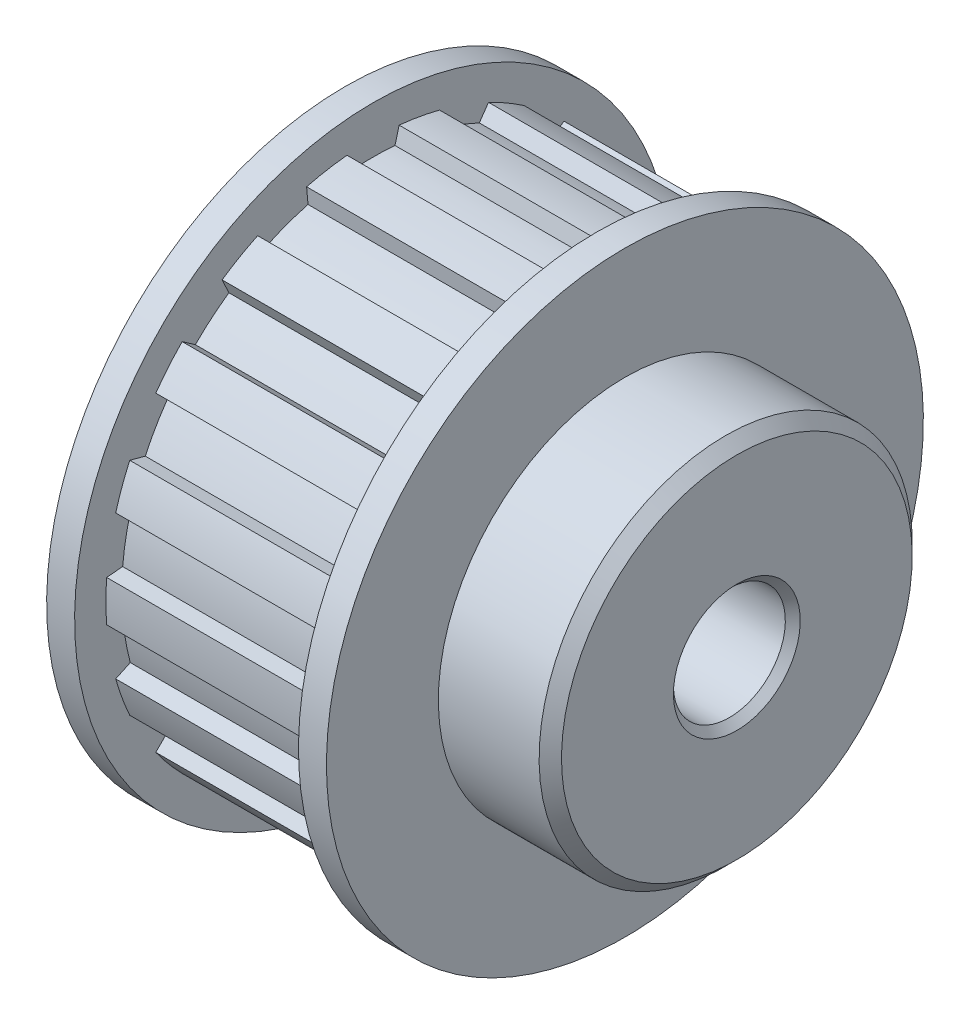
ISO-10303-21;
HEADER;
FILE_DESCRIPTION(('STEP AP214'),'2;1');
FILE_NAME('part.step','',(''),(''),'','','');
FILE_SCHEMA(('AUTOMOTIVE_DESIGN { 1 0 10303 214 1 1 1 1 }'));
ENDSEC;
DATA;
#1=APPLICATION_CONTEXT('core data for automotive mechanical design processes');
#2=APPLICATION_PROTOCOL_DEFINITION('international standard','automotive_design',2000,#1);
#3=PRODUCT_CONTEXT('',#1,'mechanical');
#4=PRODUCT('Part','Part','',(#3));
#5=PRODUCT_RELATED_PRODUCT_CATEGORY('part','',(#4));
#6=PRODUCT_DEFINITION_FORMATION('','',#4);
#7=PRODUCT_DEFINITION_CONTEXT('part definition',#1,'design');
#8=PRODUCT_DEFINITION('design','',#6,#7);
#9=PRODUCT_DEFINITION_SHAPE('','',#8);
#10=(LENGTH_UNIT() NAMED_UNIT(*) SI_UNIT(.MILLI.,.METRE.));
#11=(NAMED_UNIT(*) PLANE_ANGLE_UNIT() SI_UNIT($,.RADIAN.));
#12=(NAMED_UNIT(*) SI_UNIT($,.STERADIAN.) SOLID_ANGLE_UNIT());
#13=UNCERTAINTY_MEASURE_WITH_UNIT(LENGTH_MEASURE(1.E-05),#10,'distance_accuracy_value','');
#14=(GEOMETRIC_REPRESENTATION_CONTEXT(3) GLOBAL_UNCERTAINTY_ASSIGNED_CONTEXT((#13)) GLOBAL_UNIT_ASSIGNED_CONTEXT((#10,
#11,#12)) REPRESENTATION_CONTEXT('',''));
#15=CARTESIAN_POINT('',(0.,0.,0.));
#16=DIRECTION('',(0.,0.,1.));
#17=DIRECTION('',(1.,0.,0.));
#18=AXIS2_PLACEMENT_3D('',#15,#16,#17);
#19=CARTESIAN_POINT('',(0.,8.,0.));
#20=DIRECTION('',(-1.,0.,0.));
#21=DIRECTION('',(0.,0.,1.));
#22=AXIS2_PLACEMENT_3D('',#19,#20,#21);
#23=PLANE('',#22);
#24=CARTESIAN_POINT('',(0.,0.,0.));
#25=DIRECTION('',(1.,0.,0.));
#26=DIRECTION('',(0.,1.,0.));
#27=AXIS2_PLACEMENT_3D('',#24,#25,#26);
#28=CIRCLE('',#27,3.4);
#29=CARTESIAN_POINT('',(0.,3.4,0.));
#30=VERTEX_POINT('',#29);
#31=EDGE_CURVE('E9',#30,#30,#28,.T.);
#32=ORIENTED_EDGE('',*,*,#31,.T.);
#33=EDGE_LOOP('',(#32));
#34=FACE_BOUND('',#33,.T.);
#35=CARTESIAN_POINT('',(0.,0.,0.));
#36=DIRECTION('',(-1.,0.,0.));
#37=DIRECTION('',(0.,1.,0.));
#38=AXIS2_PLACEMENT_3D('',#35,#36,#37);
#39=CIRCLE('',#38,16.);
#40=CARTESIAN_POINT('',(0.,16.,0.));
#41=VERTEX_POINT('',#40);
#42=EDGE_CURVE('E26',#41,#41,#39,.T.);
#43=ORIENTED_EDGE('',*,*,#42,.T.);
#44=EDGE_LOOP('',(#43));
#45=FACE_BOUND('',#44,.T.);
#46=ADVANCED_FACE('F15',(#34,#45),#23,.T.);
#47=CARTESIAN_POINT('',(15.,13.,0.));
#48=DIRECTION('',(1.,0.,0.));
#49=DIRECTION('',(0.,0.,-1.));
#50=AXIS2_PLACEMENT_3D('',#47,#48,#49);
#51=PLANE('',#50);
#52=CARTESIAN_POINT('',(15.,0.,0.));
#53=DIRECTION('',(-1.,0.,0.));
#54=DIRECTION('',(0.,1.,0.));
#55=AXIS2_PLACEMENT_3D('',#52,#53,#54);
#56=CIRCLE('',#55,10.);
#57=CARTESIAN_POINT('',(15.,10.,0.));
#58=VERTEX_POINT('',#57);
#59=EDGE_CURVE('E1177',#58,#58,#56,.T.);
#60=ORIENTED_EDGE('',*,*,#59,.T.);
#61=EDGE_LOOP('',(#60));
#62=FACE_BOUND('',#61,.T.);
#63=CARTESIAN_POINT('',(15.,0.,0.));
#64=DIRECTION('',(-1.,0.,0.));
#65=DIRECTION('',(0.,1.,0.));
#66=AXIS2_PLACEMENT_3D('',#63,#64,#65);
#67=CIRCLE('',#66,16.);
#68=CARTESIAN_POINT('',(15.,16.,0.));
#69=VERTEX_POINT('',#68);
#70=EDGE_CURVE('E1102',#69,#69,#67,.T.);
#71=ORIENTED_EDGE('',*,*,#70,.F.);
#72=EDGE_LOOP('',(#71));
#73=FACE_BOUND('',#72,.T.);
#74=ADVANCED_FACE('F531',(#62,#73),#51,.T.);
#75=CARTESIAN_POINT('',(21.,4.7,0.));
#76=DIRECTION('',(1.,0.,0.));
#77=DIRECTION('',(0.,0.,-1.));
#78=AXIS2_PLACEMENT_3D('',#75,#76,#77);
#79=PLANE('',#78);
#80=CARTESIAN_POINT('',(21.,0.,0.));
#81=DIRECTION('',(-1.,0.,0.));
#82=DIRECTION('',(0.,1.,0.));
#83=AXIS2_PLACEMENT_3D('',#80,#81,#82);
#84=CIRCLE('',#83,3.4);
#85=CARTESIAN_POINT('',(21.,3.4,0.));
#86=VERTEX_POINT('',#85);
#87=EDGE_CURVE('E853',#86,#86,#84,.T.);
#88=ORIENTED_EDGE('',*,*,#87,.T.);
#89=EDGE_LOOP('',(#88));
#90=FACE_BOUND('',#89,.T.);
#91=CARTESIAN_POINT('',(21.,0.,0.));
#92=DIRECTION('',(-1.,0.,0.));
#93=DIRECTION('',(0.,1.,0.));
#94=AXIS2_PLACEMENT_3D('',#91,#92,#93);
#95=CIRCLE('',#94,9.4);
#96=CARTESIAN_POINT('',(21.,9.4,0.));
#97=VERTEX_POINT('',#96);
#98=EDGE_CURVE('E864',#97,#97,#95,.T.);
#99=ORIENTED_EDGE('',*,*,#98,.F.);
#100=EDGE_LOOP('',(#99));
#101=FACE_BOUND('',#100,.T.);
#102=ADVANCED_FACE('F537',(#90,#101),#79,.T.);
#103=CARTESIAN_POINT('',(1.5,0.,0.));
#104=DIRECTION('',(1.,0.,0.));
#105=DIRECTION('',(0.,0.,-1.));
#106=AXIS2_PLACEMENT_3D('',#103,#104,#105);
#107=PLANE('',#106);
#108=DIRECTION('',(0.,-0.0871557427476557,0.996194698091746));
#109=VECTOR('',#108,1.);
#110=CARTESIAN_POINT('',(1.5,1.1744236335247,13.4237235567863));
#111=LINE('',#110,#109);
#112=CARTESIAN_POINT('',(1.5,1.1744236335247,13.4237235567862));
#113=VERTEX_POINT('',#112);
#114=CARTESIAN_POINT('',(1.5,1.09926767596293,14.2827600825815));
#115=VERTEX_POINT('',#114);
#116=EDGE_CURVE('E949',#113,#115,#111,.T.);
#117=ORIENTED_EDGE('',*,*,#116,.F.);
#118=CARTESIAN_POINT('',(1.5,1.4344081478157E-13,-3.73034936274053E-13));
#119=DIRECTION('',(1.,0.,0.));
#120=DIRECTION('',(0.,0.258819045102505,0.965925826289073));
#121=AXIS2_PLACEMENT_3D('',#118,#119,#120);
#122=CIRCLE('',#121,13.4750000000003);
#123=CARTESIAN_POINT('',(1.5,3.48758663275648,13.0158505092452));
#124=VERTEX_POINT('',#123);
#125=EDGE_CURVE('E35',#124,#113,#122,.T.);
#126=ORIENTED_EDGE('',*,*,#125,.F.);
#127=DIRECTION('',(0.,-0.422618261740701,-0.906307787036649));
#128=VECTOR('',#127,1.);
#129=CARTESIAN_POINT('',(1.5,3.85201792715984,13.7973759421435));
#130=LINE('',#129,#128);
#131=CARTESIAN_POINT('',(1.5,3.85201792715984,13.7973759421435));
#132=VERTEX_POINT('',#131);
#133=EDGE_CURVE('E1315',#132,#124,#130,.T.);
#134=ORIENTED_EDGE('',*,*,#133,.F.);
#135=CARTESIAN_POINT('',(1.5,0.,-2.50466314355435E-13));
#136=DIRECTION('',(1.,0.,0.));
#137=DIRECTION('',(0.,0.41312149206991,0.910675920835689));
#138=AXIS2_PLACEMENT_3D('',#135,#136,#137);
#139=CIRCLE('',#138,14.3250000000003);
#140=CARTESIAN_POINT('',(1.5,5.9179653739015,13.0454325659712));
#141=VERTEX_POINT('',#140);
#142=EDGE_CURVE('E873',#141,#132,#139,.T.);
#143=ORIENTED_EDGE('',*,*,#142,.F.);
#144=DIRECTION('',(0.,0.258819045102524,0.965925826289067));
#145=VECTOR('',#144,1.);
#146=CARTESIAN_POINT('',(1.5,5.69478107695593,12.2124974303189));
#147=LINE('',#146,#145);
#148=CARTESIAN_POINT('',(1.5,5.69478107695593,12.2124974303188));
#149=VERTEX_POINT('',#148);
#150=EDGE_CURVE('E874',#149,#141,#147,.T.);
#151=ORIENTED_EDGE('',*,*,#150,.F.);
#152=CARTESIAN_POINT('',(1.5,3.81028542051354E-13,5.80868686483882E-13));
#153=DIRECTION('',(1.,0.,0.));
#154=DIRECTION('',(0.,0.573576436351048,0.819152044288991));
#155=AXIS2_PLACEMENT_3D('',#152,#153,#154);
#156=CIRCLE('',#155,13.4749999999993);
#157=CARTESIAN_POINT('',(1.5,7.72894247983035,11.0380737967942));
#158=VERTEX_POINT('',#157);
#159=EDGE_CURVE('E953',#158,#149,#156,.T.);
#160=ORIENTED_EDGE('',*,*,#159,.F.);
#161=DIRECTION('',(0.,-0.707106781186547,-0.707106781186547));
#162=VECTOR('',#161,1.);
#163=CARTESIAN_POINT('',(1.5,8.33869331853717,11.647824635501));
#164=LINE('',#163,#162);
#165=CARTESIAN_POINT('',(1.5,8.33869331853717,11.647824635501));
#166=VERTEX_POINT('',#165);
#167=EDGE_CURVE('E391',#166,#158,#164,.T.);
#168=ORIENTED_EDGE('',*,*,#167,.F.);
#169=CARTESIAN_POINT('',(1.5,3.30402372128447E-13,4.10338429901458E-13));
#170=DIRECTION('',(1.,0.,0.));
#171=DIRECTION('',(0.,0.699676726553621,0.714459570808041));
#172=AXIS2_PLACEMENT_3D('',#169,#170,#171);
#173=CIRCLE('',#172,14.3249999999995);
#174=CARTESIAN_POINT('',(1.5,10.0228691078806,10.2346333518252));
#175=VERTEX_POINT('',#174);
#176=EDGE_CURVE('E392',#175,#166,#173,.T.);
#177=ORIENTED_EDGE('',*,*,#176,.F.);
#178=DIRECTION('',(0.,0.573576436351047,0.819152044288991));
#179=VECTOR('',#178,1.);
#180=CARTESIAN_POINT('',(1.5,9.52826387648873,9.52826387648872));
#181=LINE('',#180,#179);
#182=CARTESIAN_POINT('',(1.5,9.52826387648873,9.52826387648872));
#183=VERTEX_POINT('',#182);
#184=EDGE_CURVE('E875',#183,#175,#181,.T.);
#185=ORIENTED_EDGE('',*,*,#184,.F.);
#186=CARTESIAN_POINT('',(1.5,3.99680288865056E-13,2.68229882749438E-13));
#187=DIRECTION('',(1.,0.,0.));
#188=DIRECTION('',(0.,0.819152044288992,0.573576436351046));
#189=AXIS2_PLACEMENT_3D('',#186,#187,#188);
#190=CIRCLE('',#189,13.4749999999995);
#191=CARTESIAN_POINT('',(1.5,11.0380737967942,7.72894247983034));
#192=VERTEX_POINT('',#191);
#193=EDGE_CURVE('E1105',#192,#183,#190,.T.);
#194=ORIENTED_EDGE('',*,*,#193,.F.);
#195=DIRECTION('',(0.,-0.90630778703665,-0.422618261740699));
#196=VECTOR('',#195,1.);
#197=CARTESIAN_POINT('',(1.5,11.8195992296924,8.0933737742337));
#198=LINE('',#197,#196);
#199=CARTESIAN_POINT('',(1.5,11.8195992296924,8.0933737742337));
#200=VERTEX_POINT('',#199);
#201=EDGE_CURVE('E1181',#200,#192,#198,.T.);
#202=ORIENTED_EDGE('',*,*,#201,.F.);
#203=CARTESIAN_POINT('',(1.5,-2.62900812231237E-13,-1.66089364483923E-13));
#204=DIRECTION('',(1.,0.,0.));
#205=DIRECTION('',(0.,0.901840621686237,0.432068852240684));
#206=AXIS2_PLACEMENT_3D('',#203,#204,#205);
#207=CIRCLE('',#206,14.3250000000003);
#208=CARTESIAN_POINT('',(1.5,12.9188669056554,6.18938630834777));
#209=VERTEX_POINT('',#208);
#210=EDGE_CURVE('E457',#209,#200,#207,.T.);
#211=ORIENTED_EDGE('',*,*,#210,.F.);
#212=DIRECTION('',(0.,0.819152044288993,0.573576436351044));
#213=VECTOR('',#212,1.);
#214=CARTESIAN_POINT('',(1.5,12.2124974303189,5.69478107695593));
#215=LINE('',#214,#213);
#216=CARTESIAN_POINT('',(1.5,12.2124974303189,5.69478107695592));
#217=VERTEX_POINT('',#216);
#218=EDGE_CURVE('E458',#217,#209,#215,.T.);
#219=ORIENTED_EDGE('',*,*,#218,.F.);
#220=CARTESIAN_POINT('',(1.5,0.,0.));
#221=DIRECTION('',(1.,0.,0.));
#222=DIRECTION('',(0.,0.965925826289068,0.258819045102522));
#223=AXIS2_PLACEMENT_3D('',#220,#221,#222);
#224=CIRCLE('',#223,13.475);
#225=CARTESIAN_POINT('',(1.5,13.0158505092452,3.48758663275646));
#226=VERTEX_POINT('',#225);
#227=EDGE_CURVE('E1282',#226,#217,#224,.T.);
#228=ORIENTED_EDGE('',*,*,#227,.F.);
#229=DIRECTION('',(0.,-0.996194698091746,-0.0871557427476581));
#230=VECTOR('',#229,1.);
#231=CARTESIAN_POINT('',(1.5,13.8748870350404,3.56274259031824));
#232=LINE('',#231,#230);
#233=CARTESIAN_POINT('',(1.5,13.8748870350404,3.56274259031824));
#234=VERTEX_POINT('',#233);
#235=EDGE_CURVE('E1031',#234,#226,#232,.T.);
#236=ORIENTED_EDGE('',*,*,#235,.F.);
#237=CARTESIAN_POINT('',(1.5,2.61124455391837E-13,0.));
#238=DIRECTION('',(1.,0.,0.));
#239=DIRECTION('',(0.,0.995229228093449,0.0975642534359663));
#240=AXIS2_PLACEMENT_3D('',#237,#238,#239);
#241=CIRCLE('',#240,14.3249999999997);
#242=CARTESIAN_POINT('',(1.5,14.2566586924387,1.39760793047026));
#243=VERTEX_POINT('',#242);
#244=EDGE_CURVE('E881',#243,#234,#241,.T.);
#245=ORIENTED_EDGE('',*,*,#244,.F.);
#246=DIRECTION('',(0.,0.965925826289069,0.25881904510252));
#247=VECTOR('',#246,1.);
#248=CARTESIAN_POINT('',(1.5,13.4237235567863,1.1744236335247));
#249=LINE('',#248,#247);
#250=CARTESIAN_POINT('',(1.5,13.4237235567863,1.17442363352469));
#251=VERTEX_POINT('',#250);
#252=EDGE_CURVE('E1190',#251,#243,#249,.T.);
#253=ORIENTED_EDGE('',*,*,#252,.F.);
#254=CARTESIAN_POINT('',(1.5,-3.71258579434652E-13,0.));
#255=DIRECTION('',(1.,0.,0.));
#256=DIRECTION('',(0.,0.996194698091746,-0.0871557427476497));
#257=AXIS2_PLACEMENT_3D('',#254,#255,#256);
#258=CIRCLE('',#257,13.4750000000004);
#259=CARTESIAN_POINT('',(1.5,13.4237235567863,-1.17442363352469));
#260=VERTEX_POINT('',#259);
#261=EDGE_CURVE('E1114',#260,#251,#258,.T.);
#262=ORIENTED_EDGE('',*,*,#261,.F.);
#263=DIRECTION('',(0.,-0.965925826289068,0.258819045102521));
#264=VECTOR('',#263,1.);
#265=CARTESIAN_POINT('',(1.5,14.2566586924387,-1.39760793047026));
#266=LINE('',#265,#264);
#267=CARTESIAN_POINT('',(1.5,14.2566586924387,-1.39760793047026));
#268=VERTEX_POINT('',#267);
#269=EDGE_CURVE('E1115',#268,#260,#266,.T.);
#270=ORIENTED_EDGE('',*,*,#269,.F.);
#271=CARTESIAN_POINT('',(1.5,9.00612917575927E-13,-1.24789067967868E-13));
#272=DIRECTION('',(1.,0.,0.));
#273=DIRECTION('',(0.,0.968578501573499,-0.24870803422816));
#274=AXIS2_PLACEMENT_3D('',#271,#272,#273);
#275=CIRCLE('',#274,14.3249999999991);
#276=CARTESIAN_POINT('',(1.5,13.8748870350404,-3.5627425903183));
#277=VERTEX_POINT('',#276);
#278=EDGE_CURVE('E1039',#277,#268,#275,.T.);
#279=ORIENTED_EDGE('',*,*,#278,.F.);
#280=DIRECTION('',(0.,0.996194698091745,-0.0871557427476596));
#281=VECTOR('',#280,1.);
#282=CARTESIAN_POINT('',(1.5,13.0158505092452,-3.48758663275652));
#283=LINE('',#282,#281);
#284=CARTESIAN_POINT('',(1.5,13.0158505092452,-3.48758663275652));
#285=VERTEX_POINT('',#284);
#286=EDGE_CURVE('E1040',#285,#277,#283,.T.);
#287=ORIENTED_EDGE('',*,*,#286,.F.);
#288=CARTESIAN_POINT('',(1.5,-2.8066438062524E-13,0.));
#289=DIRECTION('',(1.,0.,0.));
#290=DIRECTION('',(0.,0.90630778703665,-0.4226182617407));
#291=AXIS2_PLACEMENT_3D('',#288,#289,#290);
#292=CIRCLE('',#291,13.4750000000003);
#293=CARTESIAN_POINT('',(1.5,12.2124974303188,-5.69478107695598));
#294=VERTEX_POINT('',#293);
#295=EDGE_CURVE('E1124',#294,#285,#292,.T.);
#296=ORIENTED_EDGE('',*,*,#295,.F.);
#297=DIRECTION('',(0.,-0.819152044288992,0.573576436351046));
#298=VECTOR('',#297,1.);
#299=CARTESIAN_POINT('',(1.5,12.9188669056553,-6.18938630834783));
#300=LINE('',#299,#298);
#301=CARTESIAN_POINT('',(1.5,12.9188669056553,-6.18938630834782));
#302=VERTEX_POINT('',#301);
#303=EDGE_CURVE('E1131',#302,#294,#300,.T.);
#304=ORIENTED_EDGE('',*,*,#303,.F.);
#305=CARTESIAN_POINT('',(1.5,-2.1316282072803E-13,1.17239551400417E-13));
#306=DIRECTION('',(1.,0.,0.));
#307=DIRECTION('',(0.,0.825102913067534,-0.564982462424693));
#308=AXIS2_PLACEMENT_3D('',#305,#306,#307);
#309=CIRCLE('',#308,14.3250000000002);
#310=CARTESIAN_POINT('',(1.5,11.8195992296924,-8.09337377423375));
#311=VERTEX_POINT('',#310);
#312=EDGE_CURVE('E892',#311,#302,#309,.T.);
#313=ORIENTED_EDGE('',*,*,#312,.F.);
#314=DIRECTION('',(0.,0.906307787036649,-0.422618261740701));
#315=VECTOR('',#314,1.);
#316=CARTESIAN_POINT('',(1.5,11.0380737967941,-7.72894247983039));
#317=LINE('',#316,#315);
#318=CARTESIAN_POINT('',(1.5,11.0380737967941,-7.72894247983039));
#319=VERTEX_POINT('',#318);
#320=EDGE_CURVE('E898',#319,#311,#317,.T.);
#321=ORIENTED_EDGE('',*,*,#320,.F.);
#322=CARTESIAN_POINT('',(1.5,1.97175609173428E-13,-1.20792265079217E-13));
#323=DIRECTION('',(1.,0.,0.));
#324=DIRECTION('',(0.,0.707106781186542,-0.707106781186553));
#325=AXIS2_PLACEMENT_3D('',#322,#323,#324);
#326=CIRCLE('',#325,13.4749999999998);
#327=CARTESIAN_POINT('',(1.5,9.52826387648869,-9.52826387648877));
#328=VERTEX_POINT('',#327);
#329=EDGE_CURVE('E1053',#328,#319,#326,.T.);
#330=ORIENTED_EDGE('',*,*,#329,.F.);
#331=DIRECTION('',(0.,-0.573576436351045,0.819152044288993));
#332=VECTOR('',#331,1.);
#333=CARTESIAN_POINT('',(1.5,10.0228691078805,-10.2346333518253));
#334=LINE('',#333,#332);
#335=CARTESIAN_POINT('',(1.5,10.0228691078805,-10.2346333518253));
#336=VERTEX_POINT('',#335);
#337=EDGE_CURVE('E958',#336,#328,#334,.T.);
#338=ORIENTED_EDGE('',*,*,#337,.F.);
#339=CARTESIAN_POINT('',(1.5,2.18491891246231E-13,-3.10862446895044E-13));
#340=DIRECTION('',(1.,0.,0.));
#341=DIRECTION('',(0.,0.582107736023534,-0.813111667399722));
#342=AXIS2_PLACEMENT_3D('',#339,#340,#341);
#343=CIRCLE('',#342,14.3249999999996);
#344=CARTESIAN_POINT('',(1.5,8.33869331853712,-11.647824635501));
#345=VERTEX_POINT('',#344);
#346=EDGE_CURVE('E463',#345,#336,#343,.T.);
#347=ORIENTED_EDGE('',*,*,#346,.F.);
#348=DIRECTION('',(0.,0.707106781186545,-0.70710678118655));
#349=VECTOR('',#348,1.);
#350=CARTESIAN_POINT('',(1.5,7.72894247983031,-11.0380737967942));
#351=LINE('',#350,#349);
#352=CARTESIAN_POINT('',(1.5,7.72894247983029,-11.0380737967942));
#353=VERTEX_POINT('',#352);
#354=EDGE_CURVE('E464',#353,#345,#351,.T.);
#355=ORIENTED_EDGE('',*,*,#354,.F.);
#356=CARTESIAN_POINT('',(1.5,-2.46913600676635E-13,1.4033219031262E-13));
#357=DIRECTION('',(1.,0.,0.));
#358=DIRECTION('',(0.,0.422618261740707,-0.906307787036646));
#359=AXIS2_PLACEMENT_3D('',#356,#357,#358);
#360=CIRCLE('',#359,13.4750000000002);
#361=CARTESIAN_POINT('',(1.5,5.69478107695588,-12.2124974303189));
#362=VERTEX_POINT('',#361);
#363=EDGE_CURVE('E1289',#362,#353,#360,.T.);
#364=ORIENTED_EDGE('',*,*,#363,.F.);
#365=DIRECTION('',(0.,-0.258819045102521,0.965925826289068));
#366=VECTOR('',#365,1.);
#367=CARTESIAN_POINT('',(1.5,5.91796537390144,-13.0454325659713));
#368=LINE('',#367,#366);
#369=CARTESIAN_POINT('',(1.5,5.91796537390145,-13.0454325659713));
#370=VERTEX_POINT('',#369);
#371=EDGE_CURVE('E409',#370,#362,#368,.T.);
#372=ORIENTED_EDGE('',*,*,#371,.F.);
#373=CARTESIAN_POINT('',(1.5,4.86721773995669E-13,-7.67386154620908E-13));
#374=DIRECTION('',(1.,0.,0.));
#375=DIRECTION('',(0.,0.268901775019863,-0.963167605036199));
#376=AXIS2_PLACEMENT_3D('',#373,#374,#375);
#377=CIRCLE('',#376,14.3249999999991);
#378=CARTESIAN_POINT('',(1.5,3.85201792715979,-13.7973759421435));
#379=VERTEX_POINT('',#378);
#380=EDGE_CURVE('E907',#379,#370,#377,.T.);
#381=ORIENTED_EDGE('',*,*,#380,.F.);
#382=DIRECTION('',(0.,0.422618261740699,-0.90630778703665));
#383=VECTOR('',#382,1.);
#384=CARTESIAN_POINT('',(1.5,3.48758663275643,-13.0158505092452));
#385=LINE('',#384,#383);
#386=CARTESIAN_POINT('',(1.5,3.48758663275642,-13.0158505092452));
#387=VERTEX_POINT('',#386);
#388=EDGE_CURVE('E908',#387,#379,#385,.T.);
#389=ORIENTED_EDGE('',*,*,#388,.F.);
#390=CARTESIAN_POINT('',(1.5,0.,1.31450406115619E-13));
#391=DIRECTION('',(1.,0.,0.));
#392=DIRECTION('',(0.,0.0871557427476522,-0.996194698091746));
#393=AXIS2_PLACEMENT_3D('',#390,#391,#392);
#394=CIRCLE('',#393,13.4750000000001);
#395=CARTESIAN_POINT('',(1.5,1.17442363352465,-13.4237235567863));
#396=VERTEX_POINT('',#395);
#397=EDGE_CURVE('E909',#396,#387,#394,.T.);
#398=ORIENTED_EDGE('',*,*,#397,.F.);
#399=DIRECTION('',(0.,0.087155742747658,0.996194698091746));
#400=VECTOR('',#399,1.);
#401=CARTESIAN_POINT('',(1.5,1.09926767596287,-14.2827600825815));
#402=LINE('',#401,#400);
#403=CARTESIAN_POINT('',(1.5,1.09926767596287,-14.2827600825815));
#404=VERTEX_POINT('',#403);
#405=EDGE_CURVE('E1199',#404,#396,#402,.T.);
#406=ORIENTED_EDGE('',*,*,#405,.F.);
#407=CARTESIAN_POINT('',(1.5,0.,0.));
#408=DIRECTION('',(1.,0.,0.));
#409=DIRECTION('',(0.,-0.0767377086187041,-0.997051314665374));
#410=AXIS2_PLACEMENT_3D('',#407,#408,#409);
#411=CIRCLE('',#410,14.3250000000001);
#412=CARTESIAN_POINT('',(1.5,-1.09926767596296,-14.2827600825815));
#413=VERTEX_POINT('',#412);
#414=EDGE_CURVE('E414',#413,#404,#411,.T.);
#415=ORIENTED_EDGE('',*,*,#414,.F.);
#416=DIRECTION('',(0.,0.087155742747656,-0.996194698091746));
#417=VECTOR('',#416,1.);
#418=CARTESIAN_POINT('',(1.5,-1.17442363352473,-13.4237235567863));
#419=LINE('',#418,#417);
#420=CARTESIAN_POINT('',(1.5,-1.17442363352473,-13.4237235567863));
#421=VERTEX_POINT('',#420);
#422=EDGE_CURVE('E1323',#421,#413,#419,.T.);
#423=ORIENTED_EDGE('',*,*,#422,.F.);
#424=CARTESIAN_POINT('',(1.5,0.,3.81916720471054E-13));
#425=DIRECTION('',(1.,0.,0.));
#426=DIRECTION('',(0.,-0.258819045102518,-0.965925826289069));
#427=AXIS2_PLACEMENT_3D('',#424,#425,#426);
#428=CIRCLE('',#427,13.4750000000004);
#429=CARTESIAN_POINT('',(1.5,-3.48758663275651,-13.0158505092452));
#430=VERTEX_POINT('',#429);
#431=EDGE_CURVE('E1062',#430,#421,#428,.T.);
#432=ORIENTED_EDGE('',*,*,#431,.F.);
#433=DIRECTION('',(0.,0.422618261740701,0.906307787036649));
#434=VECTOR('',#433,1.);
#435=CARTESIAN_POINT('',(1.5,-3.85201792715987,-13.7973759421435));
#436=LINE('',#435,#434);
#437=CARTESIAN_POINT('',(1.5,-3.85201792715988,-13.7973759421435));
#438=VERTEX_POINT('',#437);
#439=EDGE_CURVE('E1063',#438,#430,#436,.T.);
#440=ORIENTED_EDGE('',*,*,#439,.F.);
#441=CARTESIAN_POINT('',(1.5,2.24709140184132E-13,3.33955085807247E-13));
#442=DIRECTION('',(1.,0.,0.));
#443=DIRECTION('',(0.,-0.413121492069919,-0.910675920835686));
#444=AXIS2_PLACEMENT_3D('',#441,#442,#443);
#445=CIRCLE('',#444,14.3250000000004);
#446=CARTESIAN_POINT('',(1.5,-5.91796537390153,-13.0454325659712));
#447=VERTEX_POINT('',#446);
#448=EDGE_CURVE('E471',#447,#438,#445,.T.);
#449=ORIENTED_EDGE('',*,*,#448,.F.);
#450=DIRECTION('',(0.,-0.258819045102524,-0.965925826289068));
#451=VECTOR('',#450,1.);
#452=CARTESIAN_POINT('',(1.5,-5.69478107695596,-12.2124974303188));
#453=LINE('',#452,#451);
#454=CARTESIAN_POINT('',(1.5,-5.69478107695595,-12.2124974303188));
#455=VERTEX_POINT('',#454);
#456=EDGE_CURVE('E1143',#455,#447,#453,.T.);
#457=ORIENTED_EDGE('',*,*,#456,.F.);
#458=CARTESIAN_POINT('',(1.5,-1.08357767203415E-13,1.75859327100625E-13));
#459=DIRECTION('',(1.,0.,0.));
#460=DIRECTION('',(0.,-0.573576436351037,-0.819152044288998));
#461=AXIS2_PLACEMENT_3D('',#458,#459,#460);
#462=CIRCLE('',#461,13.4750000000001);
#463=CARTESIAN_POINT('',(1.5,-7.72894247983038,-11.0380737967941));
#464=VERTEX_POINT('',#463);
#465=EDGE_CURVE('E1064',#464,#455,#462,.T.);
#466=ORIENTED_EDGE('',*,*,#465,.F.);
#467=DIRECTION('',(0.,0.707106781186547,0.707106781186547));
#468=VECTOR('',#467,1.);
#469=CARTESIAN_POINT('',(1.5,-8.3386933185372,-11.647824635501));
#470=LINE('',#469,#468);
#471=CARTESIAN_POINT('',(1.5,-8.33869331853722,-11.647824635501));
#472=VERTEX_POINT('',#471);
#473=EDGE_CURVE('E989',#472,#464,#470,.T.);
#474=ORIENTED_EDGE('',*,*,#473,.F.);
#475=CARTESIAN_POINT('',(1.5,0.,-3.58824081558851E-13));
#476=DIRECTION('',(1.,0.,0.));
#477=DIRECTION('',(0.,-0.699676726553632,-0.71445957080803));
#478=AXIS2_PLACEMENT_3D('',#475,#476,#477);
#479=CIRCLE('',#478,14.3249999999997);
#480=CARTESIAN_POINT('',(1.5,-10.0228691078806,-10.2346333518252));
#481=VERTEX_POINT('',#480);
#482=EDGE_CURVE('E972',#481,#472,#479,.T.);
#483=ORIENTED_EDGE('',*,*,#482,.F.);
#484=DIRECTION('',(0.,-0.573576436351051,-0.819152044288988));
#485=VECTOR('',#484,1.);
#486=CARTESIAN_POINT('',(1.5,-9.52826387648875,-9.5282638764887));
#487=LINE('',#486,#485);
#488=CARTESIAN_POINT('',(1.5,-9.52826387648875,-9.5282638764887));
#489=VERTEX_POINT('',#488);
#490=EDGE_CURVE('E420',#489,#481,#487,.T.);
#491=ORIENTED_EDGE('',*,*,#490,.F.);
#492=CARTESIAN_POINT('',(1.5,-1.13686837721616E-13,0.));
#493=DIRECTION('',(1.,0.,0.));
#494=DIRECTION('',(0.,-0.819152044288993,-0.573576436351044));
#495=AXIS2_PLACEMENT_3D('',#492,#493,#494);
#496=CIRCLE('',#495,13.4749999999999);
#497=CARTESIAN_POINT('',(1.5,-11.0380737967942,-7.72894247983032));
#498=VERTEX_POINT('',#497);
#499=EDGE_CURVE('E426',#498,#489,#496,.T.);
#500=ORIENTED_EDGE('',*,*,#499,.F.);
#501=DIRECTION('',(0.,0.906307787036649,0.422618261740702));
#502=VECTOR('',#501,1.);
#503=CARTESIAN_POINT('',(1.5,-11.8195992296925,-8.09337377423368));
#504=LINE('',#503,#502);
#505=CARTESIAN_POINT('',(1.5,-11.8195992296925,-8.09337377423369));
#506=VERTEX_POINT('',#505);
#507=EDGE_CURVE('E928',#506,#498,#504,.T.);
#508=ORIENTED_EDGE('',*,*,#507,.F.);
#509=CARTESIAN_POINT('',(1.5,1.56319401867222E-13,0.));
#510=DIRECTION('',(1.,0.,0.));
#511=DIRECTION('',(0.,-0.901840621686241,-0.432068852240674));
#512=AXIS2_PLACEMENT_3D('',#509,#510,#511);
#513=CIRCLE('',#512,14.3250000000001);
#514=CARTESIAN_POINT('',(1.5,-12.9188669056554,-6.18938630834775));
#515=VERTEX_POINT('',#514);
#516=EDGE_CURVE('E379',#515,#506,#513,.T.);
#517=ORIENTED_EDGE('',*,*,#516,.F.);
#518=DIRECTION('',(0.,-0.819152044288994,-0.573576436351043));
#519=VECTOR('',#518,1.);
#520=CARTESIAN_POINT('',(1.5,-12.2124974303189,-5.6947810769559));
#521=LINE('',#520,#519);
#522=CARTESIAN_POINT('',(1.5,-12.2124974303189,-5.69478107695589));
#523=VERTEX_POINT('',#522);
#524=EDGE_CURVE('E435',#523,#515,#521,.T.);
#525=ORIENTED_EDGE('',*,*,#524,.F.);
#526=CARTESIAN_POINT('',(1.5,-6.87450096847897E-13,-2.17159623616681E-13));
#527=DIRECTION('',(1.,0.,0.));
#528=DIRECTION('',(0.,-0.965925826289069,-0.258819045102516));
#529=AXIS2_PLACEMENT_3D('',#526,#527,#528);
#530=CIRCLE('',#529,13.4749999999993);
#531=CARTESIAN_POINT('',(1.5,-13.0158505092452,-3.48758663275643));
#532=VERTEX_POINT('',#531);
#533=EDGE_CURVE('E436',#532,#523,#530,.T.);
#534=ORIENTED_EDGE('',*,*,#533,.F.);
#535=DIRECTION('',(0.,0.996194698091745,0.0871557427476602));
#536=VECTOR('',#535,1.);
#537=CARTESIAN_POINT('',(1.5,-13.8748870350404,-3.56274259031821));
#538=LINE('',#537,#536);
#539=CARTESIAN_POINT('',(1.5,-13.8748870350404,-3.56274259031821));
#540=VERTEX_POINT('',#539);
#541=EDGE_CURVE('E485',#540,#532,#538,.T.);
#542=ORIENTED_EDGE('',*,*,#541,.F.);
#543=CARTESIAN_POINT('',(1.5,0.,0.));
#544=DIRECTION('',(1.,0.,0.));
#545=DIRECTION('',(0.,-0.995229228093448,-0.0975642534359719));
#546=AXIS2_PLACEMENT_3D('',#543,#544,#545);
#547=CIRCLE('',#546,14.325);
#548=CARTESIAN_POINT('',(1.5,-14.2566586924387,-1.39760793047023));
#549=VERTEX_POINT('',#548);
#550=EDGE_CURVE('E486',#549,#540,#547,.T.);
#551=ORIENTED_EDGE('',*,*,#550,.F.);
#552=DIRECTION('',(0.,-0.965925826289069,-0.258819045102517));
#553=VECTOR('',#552,1.);
#554=CARTESIAN_POINT('',(1.5,-13.4237235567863,-1.17442363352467));
#555=LINE('',#554,#553);
#556=CARTESIAN_POINT('',(1.5,-13.4237235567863,-1.17442363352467));
#557=VERTEX_POINT('',#556);
#558=EDGE_CURVE('E490',#557,#549,#555,.T.);
#559=ORIENTED_EDGE('',*,*,#558,.F.);
#560=CARTESIAN_POINT('',(1.5,0.,0.));
#561=DIRECTION('',(1.,0.,0.));
#562=DIRECTION('',(0.,-0.996194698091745,0.0871557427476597));
#563=AXIS2_PLACEMENT_3D('',#560,#561,#562);
#564=CIRCLE('',#563,13.475);
#565=CARTESIAN_POINT('',(1.5,-13.4237235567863,1.17442363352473));
#566=VERTEX_POINT('',#565);
#567=EDGE_CURVE('E1151',#566,#557,#564,.T.);
#568=ORIENTED_EDGE('',*,*,#567,.F.);
#569=DIRECTION('',(0.,0.965925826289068,-0.25881904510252));
#570=VECTOR('',#569,1.);
#571=CARTESIAN_POINT('',(1.5,-14.2566586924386,1.39760793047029));
#572=LINE('',#571,#570);
#573=CARTESIAN_POINT('',(1.5,-14.2566586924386,1.39760793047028));
#574=VERTEX_POINT('',#573);
#575=EDGE_CURVE('E1212',#574,#566,#572,.T.);
#576=ORIENTED_EDGE('',*,*,#575,.F.);
#577=CARTESIAN_POINT('',(1.5,-6.18172180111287E-13,3.71702668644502E-13));
#578=DIRECTION('',(1.,0.,0.));
#579=DIRECTION('',(0.,-0.968578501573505,0.248708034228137));
#580=AXIS2_PLACEMENT_3D('',#577,#578,#579);
#581=CIRCLE('',#580,14.3249999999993);
#582=CARTESIAN_POINT('',(1.5,-13.8748870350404,3.56274259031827));
#583=VERTEX_POINT('',#582);
#584=EDGE_CURVE('E1074',#583,#574,#581,.T.);
#585=ORIENTED_EDGE('',*,*,#584,.F.);
#586=DIRECTION('',(0.,-0.996194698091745,0.0871557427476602));
#587=VECTOR('',#586,1.);
#588=CARTESIAN_POINT('',(1.5,-13.0158505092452,3.48758663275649));
#589=LINE('',#588,#587);
#590=CARTESIAN_POINT('',(1.5,-13.0158505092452,3.48758663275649));
#591=VERTEX_POINT('',#590);
#592=EDGE_CURVE('E1075',#591,#583,#589,.T.);
#593=ORIENTED_EDGE('',*,*,#592,.F.);
#594=CARTESIAN_POINT('',(1.5,-2.1138646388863E-13,1.63424829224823E-13));
#595=DIRECTION('',(1.,0.,0.));
#596=DIRECTION('',(0.,-0.906307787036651,0.422618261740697));
#597=AXIS2_PLACEMENT_3D('',#594,#595,#596);
#598=CIRCLE('',#597,13.4749999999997);
#599=CARTESIAN_POINT('',(1.5,-12.2124974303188,5.69478107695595));
#600=VERTEX_POINT('',#599);
#601=EDGE_CURVE('E1368',#600,#591,#598,.T.);
#602=ORIENTED_EDGE('',*,*,#601,.F.);
#603=DIRECTION('',(0.,0.819152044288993,-0.573576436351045));
#604=VECTOR('',#603,1.);
#605=CARTESIAN_POINT('',(1.5,-12.9188669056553,6.1893863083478));
#606=LINE('',#605,#604);
#607=CARTESIAN_POINT('',(1.5,-12.9188669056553,6.1893863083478));
#608=VERTEX_POINT('',#607);
#609=EDGE_CURVE('E361',#608,#600,#606,.T.);
#610=ORIENTED_EDGE('',*,*,#609,.F.);
#611=CARTESIAN_POINT('',(1.5,4.9382720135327E-13,-1.91846538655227E-13));
#612=DIRECTION('',(1.,0.,0.));
#613=DIRECTION('',(0.,-0.825102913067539,0.564982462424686));
#614=AXIS2_PLACEMENT_3D('',#611,#612,#613);
#615=CIRCLE('',#614,14.3250000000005);
#616=CARTESIAN_POINT('',(1.5,-11.8195992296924,8.09337377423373));
#617=VERTEX_POINT('',#616);
#618=EDGE_CURVE('E342',#617,#608,#615,.T.);
#619=ORIENTED_EDGE('',*,*,#618,.F.);
#620=DIRECTION('',(0.,-0.906307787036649,0.422618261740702));
#621=VECTOR('',#620,1.);
#622=CARTESIAN_POINT('',(1.5,-11.0380737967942,7.72894247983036));
#623=LINE('',#622,#621);
#624=CARTESIAN_POINT('',(1.5,-11.0380737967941,7.72894247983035));
#625=VERTEX_POINT('',#624);
#626=EDGE_CURVE('E351',#625,#617,#623,.T.);
#627=ORIENTED_EDGE('',*,*,#626,.F.);
#628=CARTESIAN_POINT('',(1.5,-2.94875235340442E-13,3.90798504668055E-13));
#629=DIRECTION('',(1.,0.,0.));
#630=DIRECTION('',(0.,-0.70710678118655,0.707106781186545));
#631=AXIS2_PLACEMENT_3D('',#628,#629,#630);
#632=CIRCLE('',#631,13.4749999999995);
#633=CARTESIAN_POINT('',(1.5,-9.52826387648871,9.52826387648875));
#634=VERTEX_POINT('',#633);
#635=EDGE_CURVE('E352',#634,#625,#632,.T.);
#636=ORIENTED_EDGE('',*,*,#635,.F.);
#637=DIRECTION('',(0.,0.57357643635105,-0.819152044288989));
#638=VECTOR('',#637,1.);
#639=CARTESIAN_POINT('',(1.5,-10.0228691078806,10.2346333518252));
#640=LINE('',#639,#638);
#641=CARTESIAN_POINT('',(1.5,-10.0228691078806,10.2346333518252));
#642=VERTEX_POINT('',#641);
#643=EDGE_CURVE('E1162',#642,#634,#640,.T.);
#644=ORIENTED_EDGE('',*,*,#643,.F.);
#645=CARTESIAN_POINT('',(1.5,0.,0.));
#646=DIRECTION('',(1.,0.,0.));
#647=DIRECTION('',(0.,-0.582107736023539,0.813111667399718));
#648=AXIS2_PLACEMENT_3D('',#645,#646,#647);
#649=CIRCLE('',#648,14.3250000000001);
#650=CARTESIAN_POINT('',(1.5,-8.33869331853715,11.647824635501));
#651=VERTEX_POINT('',#650);
#652=EDGE_CURVE('E1163',#651,#642,#649,.T.);
#653=ORIENTED_EDGE('',*,*,#652,.F.);
#654=DIRECTION('',(0.,-0.707106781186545,0.70710678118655));
#655=VECTOR('',#654,1.);
#656=CARTESIAN_POINT('',(1.5,-7.72894247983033,11.0380737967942));
#657=LINE('',#656,#655);
#658=CARTESIAN_POINT('',(1.5,-7.72894247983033,11.0380737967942));
#659=VERTEX_POINT('',#658);
#660=EDGE_CURVE('E1722',#659,#651,#657,.T.);
#661=ORIENTED_EDGE('',*,*,#660,.F.);
#662=CARTESIAN_POINT('',(1.5,-2.69118061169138E-13,5.32907051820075E-13));
#663=DIRECTION('',(1.,0.,0.));
#664=DIRECTION('',(0.,-0.422618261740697,0.906307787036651));
#665=AXIS2_PLACEMENT_3D('',#662,#663,#664);
#666=CIRCLE('',#665,13.4749999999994);
#667=CARTESIAN_POINT('',(1.5,-5.69478107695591,12.2124974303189));
#668=VERTEX_POINT('',#667);
#669=EDGE_CURVE('E1167',#668,#659,#666,.T.);
#670=ORIENTED_EDGE('',*,*,#669,.F.);
#671=DIRECTION('',(0.,0.258819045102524,-0.965925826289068));
#672=VECTOR('',#671,1.);
#673=CARTESIAN_POINT('',(1.5,-5.91796537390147,13.0454325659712));
#674=LINE('',#673,#672);
#675=CARTESIAN_POINT('',(1.5,-5.91796537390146,13.0454325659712));
#676=VERTEX_POINT('',#675);
#677=EDGE_CURVE('E1168',#676,#668,#674,.T.);
#678=ORIENTED_EDGE('',*,*,#677,.F.);
#679=CARTESIAN_POINT('',(1.5,0.,7.14095449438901E-13));
#680=DIRECTION('',(1.,0.,0.));
#681=DIRECTION('',(0.,-0.268901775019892,0.963167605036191));
#682=AXIS2_PLACEMENT_3D('',#679,#680,#681);
#683=CIRCLE('',#682,14.3249999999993);
#684=CARTESIAN_POINT('',(1.5,-3.85201792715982,13.7973759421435));
#685=VERTEX_POINT('',#684);
#686=EDGE_CURVE('E1227',#685,#676,#683,.T.);
#687=ORIENTED_EDGE('',*,*,#686,.F.);
#688=DIRECTION('',(0.,-0.422618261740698,0.906307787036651));
#689=VECTOR('',#688,1.);
#690=CARTESIAN_POINT('',(1.5,-3.48758663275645,13.0158505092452));
#691=LINE('',#690,#689);
#692=CARTESIAN_POINT('',(1.5,-3.48758663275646,13.0158505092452));
#693=VERTEX_POINT('',#692);
#694=EDGE_CURVE('E1092',#693,#685,#691,.T.);
#695=ORIENTED_EDGE('',*,*,#694,.F.);
#696=CARTESIAN_POINT('',(1.5,-1.23900889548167E-13,2.73558953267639E-13));
#697=DIRECTION('',(1.,0.,0.));
#698=DIRECTION('',(0.,-0.0871557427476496,0.996194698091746));
#699=AXIS2_PLACEMENT_3D('',#696,#697,#698);
#700=CIRCLE('',#699,13.4749999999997);
#701=CARTESIAN_POINT('',(1.5,-1.17442363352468,13.4237235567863));
#702=VERTEX_POINT('',#701);
#703=EDGE_CURVE('E1093',#702,#693,#700,.T.);
#704=ORIENTED_EDGE('',*,*,#703,.F.);
#705=DIRECTION('',(0.,-0.0871557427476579,-0.996194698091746));
#706=VECTOR('',#705,1.);
#707=CARTESIAN_POINT('',(1.5,-1.0992676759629,14.2827600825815));
#708=LINE('',#707,#706);
#709=CARTESIAN_POINT('',(1.5,-1.0992676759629,14.2827600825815));
#710=VERTEX_POINT('',#709);
#711=EDGE_CURVE('E938',#710,#702,#708,.T.);
#712=ORIENTED_EDGE('',*,*,#711,.F.);
#713=CARTESIAN_POINT('',(1.5,0.,1.98951966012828E-13));
#714=DIRECTION('',(1.,0.,0.));
#715=DIRECTION('',(0.,0.0767377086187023,0.997051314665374));
#716=AXIS2_PLACEMENT_3D('',#713,#714,#715);
#717=CIRCLE('',#716,14.3249999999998);
#718=EDGE_CURVE('E381',#115,#710,#717,.T.);
#719=ORIENTED_EDGE('',*,*,#718,.F.);
#720=EDGE_LOOP('',(#117,#126,#134,#143,#151,#160,#168,#177,#185,#194,#202,#211,#219,#228,#236,
#245,#253,#262,#270,#279,#287,#296,#304,#313,#321,#330,#338,#347,#355,#364,#372,#381,#389,#398,
#406,#415,#423,#432,#440,#449,#457,#466,#474,#483,#491,#500,#508,#517,#525,#534,#542,#551,#559,
#568,#576,#585,#593,#602,#610,#619,#627,#636,#644,#653,#661,#670,#678,#687,#695,#704,#712,#719));
#721=FACE_BOUND('',#720,.T.);
#722=CARTESIAN_POINT('',(1.5,0.,0.));
#723=DIRECTION('',(-1.,0.,0.));
#724=DIRECTION('',(0.,1.,0.));
#725=AXIS2_PLACEMENT_3D('',#722,#723,#724);
#726=CIRCLE('',#725,16.);
#727=CARTESIAN_POINT('',(1.5,16.,0.));
#728=VERTEX_POINT('',#727);
#729=EDGE_CURVE('E945',#728,#728,#726,.T.);
#730=ORIENTED_EDGE('',*,*,#729,.F.);
#731=EDGE_LOOP('',(#730));
#732=FACE_BOUND('',#731,.T.);
#733=ADVANCED_FACE('F356',(#721,#732),#107,.T.);
#734=CARTESIAN_POINT('',(13.5,0.,0.));
#735=DIRECTION('',(-1.,0.,0.));
#736=DIRECTION('',(0.,0.,1.));
#737=AXIS2_PLACEMENT_3D('',#734,#735,#736);
#738=PLANE('',#737);
#739=CARTESIAN_POINT('',(13.5,0.,1.98951966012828E-13));
#740=DIRECTION('',(1.,0.,0.));
#741=DIRECTION('',(0.,0.0767377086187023,0.997051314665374));
#742=AXIS2_PLACEMENT_3D('',#739,#740,#741);
#743=CIRCLE('',#742,14.3249999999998);
#744=CARTESIAN_POINT('',(13.5,1.09926767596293,14.2827600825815));
#745=VERTEX_POINT('',#744);
#746=CARTESIAN_POINT('',(13.5,-1.0992676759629,14.2827600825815));
#747=VERTEX_POINT('',#746);
#748=EDGE_CURVE('E841',#745,#747,#743,.T.);
#749=ORIENTED_EDGE('',*,*,#748,.T.);
#750=DIRECTION('',(0.,-0.0871557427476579,-0.996194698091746));
#751=VECTOR('',#750,1.);
#752=CARTESIAN_POINT('',(13.5,-1.0992676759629,14.2827600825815));
#753=LINE('',#752,#751);
#754=CARTESIAN_POINT('',(13.5,-1.17442363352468,13.4237235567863));
#755=VERTEX_POINT('',#754);
#756=EDGE_CURVE('E833',#747,#755,#753,.T.);
#757=ORIENTED_EDGE('',*,*,#756,.T.);
#758=CARTESIAN_POINT('',(13.5,-1.23900889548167E-13,2.73558953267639E-13));
#759=DIRECTION('',(1.,0.,0.));
#760=DIRECTION('',(0.,-0.0871557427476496,0.996194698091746));
#761=AXIS2_PLACEMENT_3D('',#758,#759,#760);
#762=CIRCLE('',#761,13.4749999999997);
#763=CARTESIAN_POINT('',(13.5,-3.48758663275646,13.0158505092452));
#764=VERTEX_POINT('',#763);
#765=EDGE_CURVE('E842',#755,#764,#762,.T.);
#766=ORIENTED_EDGE('',*,*,#765,.T.);
#767=DIRECTION('',(0.,-0.422618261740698,0.906307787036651));
#768=VECTOR('',#767,1.);
#769=CARTESIAN_POINT('',(13.5,-3.48758663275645,13.0158505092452));
#770=LINE('',#769,#768);
#771=CARTESIAN_POINT('',(13.5,-3.85201792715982,13.7973759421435));
#772=VERTEX_POINT('',#771);
#773=EDGE_CURVE('E445',#764,#772,#770,.T.);
#774=ORIENTED_EDGE('',*,*,#773,.T.);
#775=CARTESIAN_POINT('',(13.5,0.,7.14095449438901E-13));
#776=DIRECTION('',(1.,0.,0.));
#777=DIRECTION('',(0.,-0.268901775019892,0.963167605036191));
#778=AXIS2_PLACEMENT_3D('',#775,#776,#777);
#779=CIRCLE('',#778,14.3249999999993);
#780=CARTESIAN_POINT('',(13.5,-5.91796537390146,13.0454325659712));
#781=VERTEX_POINT('',#780);
#782=EDGE_CURVE('E441',#772,#781,#779,.T.);
#783=ORIENTED_EDGE('',*,*,#782,.T.);
#784=DIRECTION('',(0.,0.258819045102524,-0.965925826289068));
#785=VECTOR('',#784,1.);
#786=CARTESIAN_POINT('',(13.5,-5.91796537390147,13.0454325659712));
#787=LINE('',#786,#785);
#788=CARTESIAN_POINT('',(13.5,-5.69478107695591,12.2124974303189));
#789=VERTEX_POINT('',#788);
#790=EDGE_CURVE('E446',#781,#789,#787,.T.);
#791=ORIENTED_EDGE('',*,*,#790,.T.);
#792=CARTESIAN_POINT('',(13.5,-2.69118061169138E-13,5.32907051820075E-13));
#793=DIRECTION('',(1.,0.,0.));
#794=DIRECTION('',(0.,-0.422618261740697,0.906307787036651));
#795=AXIS2_PLACEMENT_3D('',#792,#793,#794);
#796=CIRCLE('',#795,13.4749999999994);
#797=CARTESIAN_POINT('',(13.5,-7.72894247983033,11.0380737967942));
#798=VERTEX_POINT('',#797);
#799=EDGE_CURVE('E1085',#789,#798,#796,.T.);
#800=ORIENTED_EDGE('',*,*,#799,.T.);
#801=DIRECTION('',(0.,-0.707106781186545,0.70710678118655));
#802=VECTOR('',#801,1.);
#803=CARTESIAN_POINT('',(13.5,-7.72894247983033,11.0380737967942));
#804=LINE('',#803,#802);
#805=CARTESIAN_POINT('',(13.5,-8.33869331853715,11.647824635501));
#806=VERTEX_POINT('',#805);
#807=EDGE_CURVE('E1081',#798,#806,#804,.T.);
#808=ORIENTED_EDGE('',*,*,#807,.T.);
#809=CARTESIAN_POINT('',(13.5,0.,0.));
#810=DIRECTION('',(1.,0.,0.));
#811=DIRECTION('',(0.,-0.582107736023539,0.813111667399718));
#812=AXIS2_PLACEMENT_3D('',#809,#810,#811);
#813=CIRCLE('',#812,14.3250000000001);
#814=CARTESIAN_POINT('',(13.5,-10.0228691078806,10.2346333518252));
#815=VERTEX_POINT('',#814);
#816=EDGE_CURVE('E1080',#806,#815,#813,.T.);
#817=ORIENTED_EDGE('',*,*,#816,.T.);
#818=DIRECTION('',(0.,0.57357643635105,-0.819152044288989));
#819=VECTOR('',#818,1.);
#820=CARTESIAN_POINT('',(13.5,-10.0228691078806,10.2346333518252));
#821=LINE('',#820,#819);
#822=CARTESIAN_POINT('',(13.5,-9.52826387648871,9.52826387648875));
#823=VERTEX_POINT('',#822);
#824=EDGE_CURVE('E1076',#815,#823,#821,.T.);
#825=ORIENTED_EDGE('',*,*,#824,.T.);
#826=CARTESIAN_POINT('',(13.5,-2.94875235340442E-13,3.90798504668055E-13));
#827=DIRECTION('',(1.,0.,0.));
#828=DIRECTION('',(0.,-0.70710678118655,0.707106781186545));
#829=AXIS2_PLACEMENT_3D('',#826,#827,#828);
#830=CIRCLE('',#829,13.4749999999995);
#831=CARTESIAN_POINT('',(13.5,-11.0380737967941,7.72894247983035));
#832=VERTEX_POINT('',#831);
#833=EDGE_CURVE('E440',#823,#832,#830,.T.);
#834=ORIENTED_EDGE('',*,*,#833,.T.);
#835=DIRECTION('',(0.,-0.906307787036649,0.422618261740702));
#836=VECTOR('',#835,1.);
#837=CARTESIAN_POINT('',(13.5,-11.0380737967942,7.72894247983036));
#838=LINE('',#837,#836);
#839=CARTESIAN_POINT('',(13.5,-11.8195992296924,8.09337377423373));
#840=VERTEX_POINT('',#839);
#841=EDGE_CURVE('E437',#832,#840,#838,.T.);
#842=ORIENTED_EDGE('',*,*,#841,.T.);
#843=CARTESIAN_POINT('',(13.5,4.9382720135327E-13,-1.91846538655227E-13));
#844=DIRECTION('',(1.,0.,0.));
#845=DIRECTION('',(0.,-0.825102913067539,0.564982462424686));
#846=AXIS2_PLACEMENT_3D('',#843,#844,#845);
#847=CIRCLE('',#846,14.3250000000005);
#848=CARTESIAN_POINT('',(13.5,-12.9188669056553,6.1893863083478));
#849=VERTEX_POINT('',#848);
#850=EDGE_CURVE('E345',#840,#849,#847,.T.);
#851=ORIENTED_EDGE('',*,*,#850,.T.);
#852=DIRECTION('',(0.,0.819152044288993,-0.573576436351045));
#853=VECTOR('',#852,1.);
#854=CARTESIAN_POINT('',(13.5,-12.9188669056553,6.1893863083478));
#855=LINE('',#854,#853);
#856=CARTESIAN_POINT('',(13.5,-12.2124974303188,5.69478107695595));
#857=VERTEX_POINT('',#856);
#858=EDGE_CURVE('E1016',#849,#857,#855,.T.);
#859=ORIENTED_EDGE('',*,*,#858,.T.);
#860=CARTESIAN_POINT('',(13.5,-2.1138646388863E-13,1.63424829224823E-13));
#861=DIRECTION('',(1.,0.,0.));
#862=DIRECTION('',(0.,-0.906307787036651,0.422618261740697));
#863=AXIS2_PLACEMENT_3D('',#860,#861,#862);
#864=CIRCLE('',#863,13.4749999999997);
#865=CARTESIAN_POINT('',(13.5,-13.0158505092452,3.48758663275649));
#866=VERTEX_POINT('',#865);
#867=EDGE_CURVE('E1013',#857,#866,#864,.T.);
#868=ORIENTED_EDGE('',*,*,#867,.T.);
#869=DIRECTION('',(0.,-0.996194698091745,0.0871557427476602));
#870=VECTOR('',#869,1.);
#871=CARTESIAN_POINT('',(13.5,-13.0158505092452,3.48758663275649));
#872=LINE('',#871,#870);
#873=CARTESIAN_POINT('',(13.5,-13.8748870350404,3.56274259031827));
#874=VERTEX_POINT('',#873);
#875=EDGE_CURVE('E1011',#866,#874,#872,.T.);
#876=ORIENTED_EDGE('',*,*,#875,.T.);
#877=CARTESIAN_POINT('',(13.5,-6.18172180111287E-13,3.71702668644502E-13));
#878=DIRECTION('',(1.,0.,0.));
#879=DIRECTION('',(0.,-0.968578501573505,0.248708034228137));
#880=AXIS2_PLACEMENT_3D('',#877,#878,#879);
#881=CIRCLE('',#880,14.3249999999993);
#882=CARTESIAN_POINT('',(13.5,-14.2566586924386,1.39760793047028));
#883=VERTEX_POINT('',#882);
#884=EDGE_CURVE('E1008',#874,#883,#881,.T.);
#885=ORIENTED_EDGE('',*,*,#884,.T.);
#886=DIRECTION('',(0.,0.965925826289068,-0.25881904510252));
#887=VECTOR('',#886,1.);
#888=CARTESIAN_POINT('',(13.5,-14.2566586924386,1.39760793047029));
#889=LINE('',#888,#887);
#890=CARTESIAN_POINT('',(13.5,-13.4237235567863,1.17442363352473));
#891=VERTEX_POINT('',#890);
#892=EDGE_CURVE('E1012',#883,#891,#889,.T.);
#893=ORIENTED_EDGE('',*,*,#892,.T.);
#894=CARTESIAN_POINT('',(13.5,0.,0.));
#895=DIRECTION('',(1.,0.,0.));
#896=DIRECTION('',(0.,-0.996194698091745,0.0871557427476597));
#897=AXIS2_PLACEMENT_3D('',#894,#895,#896);
#898=CIRCLE('',#897,13.475);
#899=CARTESIAN_POINT('',(13.5,-13.4237235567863,-1.17442363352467));
#900=VERTEX_POINT('',#899);
#901=EDGE_CURVE('E1271',#891,#900,#898,.T.);
#902=ORIENTED_EDGE('',*,*,#901,.T.);
#903=DIRECTION('',(0.,-0.965925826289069,-0.258819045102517));
#904=VECTOR('',#903,1.);
#905=CARTESIAN_POINT('',(13.5,-13.4237235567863,-1.17442363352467));
#906=LINE('',#905,#904);
#907=CARTESIAN_POINT('',(13.5,-14.2566586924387,-1.39760793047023));
#908=VERTEX_POINT('',#907);
#909=EDGE_CURVE('E495',#900,#908,#906,.T.);
#910=ORIENTED_EDGE('',*,*,#909,.T.);
#911=CARTESIAN_POINT('',(13.5,0.,0.));
#912=DIRECTION('',(1.,0.,0.));
#913=DIRECTION('',(0.,-0.995229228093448,-0.0975642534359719));
#914=AXIS2_PLACEMENT_3D('',#911,#912,#913);
#915=CIRCLE('',#914,14.325);
#916=CARTESIAN_POINT('',(13.5,-13.8748870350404,-3.56274259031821));
#917=VERTEX_POINT('',#916);
#918=EDGE_CURVE('E491',#908,#917,#915,.T.);
#919=ORIENTED_EDGE('',*,*,#918,.T.);
#920=DIRECTION('',(0.,0.996194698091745,0.0871557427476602));
#921=VECTOR('',#920,1.);
#922=CARTESIAN_POINT('',(13.5,-13.8748870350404,-3.56274259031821));
#923=LINE('',#922,#921);
#924=CARTESIAN_POINT('',(13.5,-13.0158505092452,-3.48758663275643));
#925=VERTEX_POINT('',#924);
#926=EDGE_CURVE('E496',#917,#925,#923,.T.);
#927=ORIENTED_EDGE('',*,*,#926,.T.);
#928=CARTESIAN_POINT('',(13.5,-6.87450096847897E-13,-2.17159623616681E-13));
#929=DIRECTION('',(1.,0.,0.));
#930=DIRECTION('',(0.,-0.965925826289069,-0.258819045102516));
#931=AXIS2_PLACEMENT_3D('',#928,#929,#930);
#932=CIRCLE('',#931,13.4749999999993);
#933=CARTESIAN_POINT('',(13.5,-12.2124974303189,-5.69478107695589));
#934=VERTEX_POINT('',#933);
#935=EDGE_CURVE('E1150',#925,#934,#932,.T.);
#936=ORIENTED_EDGE('',*,*,#935,.T.);
#937=DIRECTION('',(0.,-0.819152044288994,-0.573576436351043));
#938=VECTOR('',#937,1.);
#939=CARTESIAN_POINT('',(13.5,-12.2124974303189,-5.6947810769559));
#940=LINE('',#939,#938);
#941=CARTESIAN_POINT('',(13.5,-12.9188669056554,-6.18938630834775));
#942=VERTEX_POINT('',#941);
#943=EDGE_CURVE('E1146',#934,#942,#940,.T.);
#944=ORIENTED_EDGE('',*,*,#943,.T.);
#945=CARTESIAN_POINT('',(13.5,1.56319401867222E-13,0.));
#946=DIRECTION('',(1.,0.,0.));
#947=DIRECTION('',(0.,-0.901840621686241,-0.432068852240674));
#948=AXIS2_PLACEMENT_3D('',#945,#946,#947);
#949=CIRCLE('',#948,14.3250000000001);
#950=CARTESIAN_POINT('',(13.5,-11.8195992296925,-8.09337377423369));
#951=VERTEX_POINT('',#950);
#952=EDGE_CURVE('E1006',#942,#951,#949,.T.);
#953=ORIENTED_EDGE('',*,*,#952,.T.);
#954=DIRECTION('',(0.,0.906307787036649,0.422618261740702));
#955=VECTOR('',#954,1.);
#956=CARTESIAN_POINT('',(13.5,-11.8195992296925,-8.09337377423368));
#957=LINE('',#956,#955);
#958=CARTESIAN_POINT('',(13.5,-11.0380737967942,-7.72894247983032));
#959=VERTEX_POINT('',#958);
#960=EDGE_CURVE('E1002',#951,#959,#957,.T.);
#961=ORIENTED_EDGE('',*,*,#960,.T.);
#962=CARTESIAN_POINT('',(13.5,-1.13686837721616E-13,0.));
#963=DIRECTION('',(1.,0.,0.));
#964=DIRECTION('',(0.,-0.819152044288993,-0.573576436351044));
#965=AXIS2_PLACEMENT_3D('',#962,#963,#964);
#966=CIRCLE('',#965,13.4749999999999);
#967=CARTESIAN_POINT('',(13.5,-9.52826387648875,-9.5282638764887));
#968=VERTEX_POINT('',#967);
#969=EDGE_CURVE('E1007',#959,#968,#966,.T.);
#970=ORIENTED_EDGE('',*,*,#969,.T.);
#971=DIRECTION('',(0.,-0.573576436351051,-0.819152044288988));
#972=VECTOR('',#971,1.);
#973=CARTESIAN_POINT('',(13.5,-9.52826387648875,-9.5282638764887));
#974=LINE('',#973,#972);
#975=CARTESIAN_POINT('',(13.5,-10.0228691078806,-10.2346333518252));
#976=VERTEX_POINT('',#975);
#977=EDGE_CURVE('E978',#968,#976,#974,.T.);
#978=ORIENTED_EDGE('',*,*,#977,.T.);
#979=CARTESIAN_POINT('',(13.5,0.,-3.58824081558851E-13));
#980=DIRECTION('',(1.,0.,0.));
#981=DIRECTION('',(0.,-0.699676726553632,-0.71445957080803));
#982=AXIS2_PLACEMENT_3D('',#979,#980,#981);
#983=CIRCLE('',#982,14.3249999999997);
#984=CARTESIAN_POINT('',(13.5,-8.33869331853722,-11.647824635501));
#985=VERTEX_POINT('',#984);
#986=EDGE_CURVE('E985',#976,#985,#983,.T.);
#987=ORIENTED_EDGE('',*,*,#986,.T.);
#988=DIRECTION('',(0.,0.707106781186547,0.707106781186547));
#989=VECTOR('',#988,1.);
#990=CARTESIAN_POINT('',(13.5,-8.3386933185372,-11.647824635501));
#991=LINE('',#990,#989);
#992=CARTESIAN_POINT('',(13.5,-7.72894247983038,-11.0380737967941));
#993=VERTEX_POINT('',#992);
#994=EDGE_CURVE('E1353',#985,#993,#991,.T.);
#995=ORIENTED_EDGE('',*,*,#994,.T.);
#996=CARTESIAN_POINT('',(13.5,-1.08357767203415E-13,1.75859327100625E-13));
#997=DIRECTION('',(1.,0.,0.));
#998=DIRECTION('',(0.,-0.573576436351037,-0.819152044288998));
#999=AXIS2_PLACEMENT_3D('',#996,#997,#998);
#1000=CIRCLE('',#999,13.4750000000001);
#1001=CARTESIAN_POINT('',(13.5,-5.69478107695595,-12.2124974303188));
#1002=VERTEX_POINT('',#1001);
#1003=EDGE_CURVE('E1350',#993,#1002,#1000,.T.);
#1004=ORIENTED_EDGE('',*,*,#1003,.T.);
#1005=DIRECTION('',(0.,-0.258819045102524,-0.965925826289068));
#1006=VECTOR('',#1005,1.);
#1007=CARTESIAN_POINT('',(13.5,-5.69478107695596,-12.2124974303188));
#1008=LINE('',#1007,#1006);
#1009=CARTESIAN_POINT('',(13.5,-5.91796537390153,-13.0454325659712));
#1010=VERTEX_POINT('',#1009);
#1011=EDGE_CURVE('E924',#1002,#1010,#1008,.T.);
#1012=ORIENTED_EDGE('',*,*,#1011,.T.);
#1013=CARTESIAN_POINT('',(13.5,2.24709140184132E-13,3.33955085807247E-13));
#1014=DIRECTION('',(1.,0.,0.));
#1015=DIRECTION('',(0.,-0.413121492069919,-0.910675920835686));
#1016=AXIS2_PLACEMENT_3D('',#1013,#1014,#1015);
#1017=CIRCLE('',#1016,14.3250000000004);
#1018=CARTESIAN_POINT('',(13.5,-3.85201792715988,-13.7973759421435));
#1019=VERTEX_POINT('',#1018);
#1020=EDGE_CURVE('E919',#1010,#1019,#1017,.T.);
#1021=ORIENTED_EDGE('',*,*,#1020,.T.);
#1022=DIRECTION('',(0.,0.422618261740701,0.906307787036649));
#1023=VECTOR('',#1022,1.);
#1024=CARTESIAN_POINT('',(13.5,-3.85201792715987,-13.7973759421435));
#1025=LINE('',#1024,#1023);
#1026=CARTESIAN_POINT('',(13.5,-3.48758663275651,-13.0158505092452));
#1027=VERTEX_POINT('',#1026);
#1028=EDGE_CURVE('E915',#1019,#1027,#1025,.T.);
#1029=ORIENTED_EDGE('',*,*,#1028,.T.);
#1030=CARTESIAN_POINT('',(13.5,0.,3.81916720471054E-13));
#1031=DIRECTION('',(1.,0.,0.));
#1032=DIRECTION('',(0.,-0.258819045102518,-0.965925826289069));
#1033=AXIS2_PLACEMENT_3D('',#1030,#1031,#1032);
#1034=CIRCLE('',#1033,13.4750000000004);
#1035=CARTESIAN_POINT('',(13.5,-1.17442363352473,-13.4237235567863));
#1036=VERTEX_POINT('',#1035);
#1037=EDGE_CURVE('E920',#1027,#1036,#1034,.T.);
#1038=ORIENTED_EDGE('',*,*,#1037,.T.);
#1039=DIRECTION('',(0.,0.087155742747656,-0.996194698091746));
#1040=VECTOR('',#1039,1.);
#1041=CARTESIAN_POINT('',(13.5,-1.17442363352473,-13.4237235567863));
#1042=LINE('',#1041,#1040);
#1043=CARTESIAN_POINT('',(13.5,-1.09926767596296,-14.2827600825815));
#1044=VERTEX_POINT('',#1043);
#1045=EDGE_CURVE('E1268',#1036,#1044,#1042,.T.);
#1046=ORIENTED_EDGE('',*,*,#1045,.T.);
#1047=CARTESIAN_POINT('',(13.5,0.,0.));
#1048=DIRECTION('',(1.,0.,0.));
#1049=DIRECTION('',(0.,-0.0767377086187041,-0.997051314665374));
#1050=AXIS2_PLACEMENT_3D('',#1047,#1048,#1049);
#1051=CIRCLE('',#1050,14.3250000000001);
#1052=CARTESIAN_POINT('',(13.5,1.09926767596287,-14.2827600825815));
#1053=VERTEX_POINT('',#1052);
#1054=EDGE_CURVE('E1299',#1044,#1053,#1051,.T.);
#1055=ORIENTED_EDGE('',*,*,#1054,.T.);
#1056=DIRECTION('',(0.,0.087155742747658,0.996194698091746));
#1057=VECTOR('',#1056,1.);
#1058=CARTESIAN_POINT('',(13.5,1.09926767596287,-14.2827600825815));
#1059=LINE('',#1058,#1057);
#1060=CARTESIAN_POINT('',(13.5,1.17442363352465,-13.4237235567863));
#1061=VERTEX_POINT('',#1060);
#1062=EDGE_CURVE('E1137',#1053,#1061,#1059,.T.);
#1063=ORIENTED_EDGE('',*,*,#1062,.T.);
#1064=CARTESIAN_POINT('',(13.5,0.,1.31450406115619E-13));
#1065=DIRECTION('',(1.,0.,0.));
#1066=DIRECTION('',(0.,0.0871557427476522,-0.996194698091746));
#1067=AXIS2_PLACEMENT_3D('',#1064,#1065,#1066);
#1068=CIRCLE('',#1067,13.4750000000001);
#1069=CARTESIAN_POINT('',(13.5,3.48758663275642,-13.0158505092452));
#1070=VERTEX_POINT('',#1069);
#1071=EDGE_CURVE('E968',#1061,#1070,#1068,.T.);
#1072=ORIENTED_EDGE('',*,*,#1071,.T.);
#1073=DIRECTION('',(0.,0.422618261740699,-0.90630778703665));
#1074=VECTOR('',#1073,1.);
#1075=CARTESIAN_POINT('',(13.5,3.48758663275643,-13.0158505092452));
#1076=LINE('',#1075,#1074);
#1077=CARTESIAN_POINT('',(13.5,3.85201792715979,-13.7973759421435));
#1078=VERTEX_POINT('',#1077);
#1079=EDGE_CURVE('E964',#1070,#1078,#1076,.T.);
#1080=ORIENTED_EDGE('',*,*,#1079,.T.);
#1081=CARTESIAN_POINT('',(13.5,4.86721773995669E-13,-7.67386154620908E-13));
#1082=DIRECTION('',(1.,0.,0.));
#1083=DIRECTION('',(0.,0.268901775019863,-0.963167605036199));
#1084=AXIS2_PLACEMENT_3D('',#1081,#1082,#1083);
#1085=CIRCLE('',#1084,14.3249999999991);
#1086=CARTESIAN_POINT('',(13.5,5.91796537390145,-13.0454325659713));
#1087=VERTEX_POINT('',#1086);
#1088=EDGE_CURVE('E969',#1078,#1087,#1085,.T.);
#1089=ORIENTED_EDGE('',*,*,#1088,.T.);
#1090=DIRECTION('',(0.,-0.258819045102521,0.965925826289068));
#1091=VECTOR('',#1090,1.);
#1092=CARTESIAN_POINT('',(13.5,5.91796537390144,-13.0454325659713));
#1093=LINE('',#1092,#1091);
#1094=CARTESIAN_POINT('',(13.5,5.69478107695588,-12.2124974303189));
#1095=VERTEX_POINT('',#1094);
#1096=EDGE_CURVE('E1292',#1087,#1095,#1093,.T.);
#1097=ORIENTED_EDGE('',*,*,#1096,.T.);
#1098=CARTESIAN_POINT('',(13.5,-2.46913600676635E-13,1.4033219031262E-13));
#1099=DIRECTION('',(1.,0.,0.));
#1100=DIRECTION('',(0.,0.422618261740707,-0.906307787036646));
#1101=AXIS2_PLACEMENT_3D('',#1098,#1099,#1100);
#1102=CIRCLE('',#1101,13.4750000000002);
#1103=CARTESIAN_POINT('',(13.5,7.72894247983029,-11.0380737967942));
#1104=VERTEX_POINT('',#1103);
#1105=EDGE_CURVE('E469',#1095,#1104,#1102,.T.);
#1106=ORIENTED_EDGE('',*,*,#1105,.T.);
#1107=DIRECTION('',(0.,0.707106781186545,-0.70710678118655));
#1108=VECTOR('',#1107,1.);
#1109=CARTESIAN_POINT('',(13.5,7.72894247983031,-11.0380737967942));
#1110=LINE('',#1109,#1108);
#1111=CARTESIAN_POINT('',(13.5,8.33869331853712,-11.647824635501));
#1112=VERTEX_POINT('',#1111);
#1113=EDGE_CURVE('E465',#1104,#1112,#1110,.T.);
#1114=ORIENTED_EDGE('',*,*,#1113,.T.);
#1115=CARTESIAN_POINT('',(13.5,2.18491891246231E-13,-3.10862446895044E-13));
#1116=DIRECTION('',(1.,0.,0.));
#1117=DIRECTION('',(0.,0.582107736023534,-0.813111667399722));
#1118=AXIS2_PLACEMENT_3D('',#1115,#1116,#1117);
#1119=CIRCLE('',#1118,14.3249999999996);
#1120=CARTESIAN_POINT('',(13.5,10.0228691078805,-10.2346333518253));
#1121=VERTEX_POINT('',#1120);
#1122=EDGE_CURVE('E470',#1112,#1121,#1119,.T.);
#1123=ORIENTED_EDGE('',*,*,#1122,.T.);
#1124=DIRECTION('',(0.,-0.573576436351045,0.819152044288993));
#1125=VECTOR('',#1124,1.);
#1126=CARTESIAN_POINT('',(13.5,10.0228691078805,-10.2346333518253));
#1127=LINE('',#1126,#1125);
#1128=CARTESIAN_POINT('',(13.5,9.52826387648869,-9.52826387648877));
#1129=VERTEX_POINT('',#1128);
#1130=EDGE_CURVE('E1194',#1121,#1129,#1127,.T.);
#1131=ORIENTED_EDGE('',*,*,#1130,.T.);
#1132=CARTESIAN_POINT('',(13.5,1.97175609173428E-13,-1.20792265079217E-13));
#1133=DIRECTION('',(1.,0.,0.));
#1134=DIRECTION('',(0.,0.707106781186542,-0.707106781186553));
#1135=AXIS2_PLACEMENT_3D('',#1132,#1133,#1134);
#1136=CIRCLE('',#1135,13.4749999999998);
#1137=CARTESIAN_POINT('',(13.5,11.0380737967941,-7.72894247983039));
#1138=VERTEX_POINT('',#1137);
#1139=EDGE_CURVE('E1198',#1129,#1138,#1136,.T.);
#1140=ORIENTED_EDGE('',*,*,#1139,.T.);
#1141=DIRECTION('',(0.,0.906307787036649,-0.422618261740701));
#1142=VECTOR('',#1141,1.);
#1143=CARTESIAN_POINT('',(13.5,11.0380737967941,-7.72894247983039));
#1144=LINE('',#1143,#1142);
#1145=CARTESIAN_POINT('',(13.5,11.8195992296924,-8.09337377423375));
#1146=VERTEX_POINT('',#1145);
#1147=EDGE_CURVE('E1255',#1138,#1146,#1144,.T.);
#1148=ORIENTED_EDGE('',*,*,#1147,.T.);
#1149=CARTESIAN_POINT('',(13.5,-2.1316282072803E-13,1.17239551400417E-13));
#1150=DIRECTION('',(1.,0.,0.));
#1151=DIRECTION('',(0.,0.825102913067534,-0.564982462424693));
#1152=AXIS2_PLACEMENT_3D('',#1149,#1150,#1151);
#1153=CIRCLE('',#1152,14.3250000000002);
#1154=CARTESIAN_POINT('',(13.5,12.9188669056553,-6.18938630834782));
#1155=VERTEX_POINT('',#1154);
#1156=EDGE_CURVE('E1049',#1146,#1155,#1153,.T.);
#1157=ORIENTED_EDGE('',*,*,#1156,.T.);
#1158=DIRECTION('',(0.,-0.819152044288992,0.573576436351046));
#1159=VECTOR('',#1158,1.);
#1160=CARTESIAN_POINT('',(13.5,12.9188669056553,-6.18938630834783));
#1161=LINE('',#1160,#1159);
#1162=CARTESIAN_POINT('',(13.5,12.2124974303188,-5.69478107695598));
#1163=VERTEX_POINT('',#1162);
#1164=EDGE_CURVE('E1045',#1155,#1163,#1161,.T.);
#1165=ORIENTED_EDGE('',*,*,#1164,.T.);
#1166=CARTESIAN_POINT('',(13.5,-2.8066438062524E-13,0.));
#1167=DIRECTION('',(1.,0.,0.));
#1168=DIRECTION('',(0.,0.90630778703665,-0.4226182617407));
#1169=AXIS2_PLACEMENT_3D('',#1166,#1167,#1168);
#1170=CIRCLE('',#1169,13.4750000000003);
#1171=CARTESIAN_POINT('',(13.5,13.0158505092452,-3.48758663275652));
#1172=VERTEX_POINT('',#1171);
#1173=EDGE_CURVE('E1044',#1163,#1172,#1170,.T.);
#1174=ORIENTED_EDGE('',*,*,#1173,.T.);
#1175=DIRECTION('',(0.,0.996194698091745,-0.0871557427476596));
#1176=VECTOR('',#1175,1.);
#1177=CARTESIAN_POINT('',(13.5,13.0158505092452,-3.48758663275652));
#1178=LINE('',#1177,#1176);
#1179=CARTESIAN_POINT('',(13.5,13.8748870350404,-3.5627425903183));
#1180=VERTEX_POINT('',#1179);
#1181=EDGE_CURVE('E407',#1172,#1180,#1178,.T.);
#1182=ORIENTED_EDGE('',*,*,#1181,.T.);
#1183=CARTESIAN_POINT('',(13.5,9.00612917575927E-13,-1.24789067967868E-13));
#1184=DIRECTION('',(1.,0.,0.));
#1185=DIRECTION('',(0.,0.968578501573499,-0.24870803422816));
#1186=AXIS2_PLACEMENT_3D('',#1183,#1184,#1185);
#1187=CIRCLE('',#1186,14.3249999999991);
#1188=CARTESIAN_POINT('',(13.5,14.2566586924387,-1.39760793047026));
#1189=VERTEX_POINT('',#1188);
#1190=EDGE_CURVE('E403',#1180,#1189,#1187,.T.);
#1191=ORIENTED_EDGE('',*,*,#1190,.T.);
#1192=DIRECTION('',(0.,-0.965925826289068,0.258819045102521));
#1193=VECTOR('',#1192,1.);
#1194=CARTESIAN_POINT('',(13.5,14.2566586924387,-1.39760793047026));
#1195=LINE('',#1194,#1193);
#1196=CARTESIAN_POINT('',(13.5,13.4237235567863,-1.17442363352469));
#1197=VERTEX_POINT('',#1196);
#1198=EDGE_CURVE('E408',#1189,#1197,#1195,.T.);
#1199=ORIENTED_EDGE('',*,*,#1198,.T.);
#1200=CARTESIAN_POINT('',(13.5,-3.71258579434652E-13,0.));
#1201=DIRECTION('',(1.,0.,0.));
#1202=DIRECTION('',(0.,0.996194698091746,-0.0871557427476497));
#1203=AXIS2_PLACEMENT_3D('',#1200,#1201,#1202);
#1204=CIRCLE('',#1203,13.4750000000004);
#1205=CARTESIAN_POINT('',(13.5,13.4237235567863,1.17442363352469));
#1206=VERTEX_POINT('',#1205);
#1207=EDGE_CURVE('E887',#1197,#1206,#1204,.T.);
#1208=ORIENTED_EDGE('',*,*,#1207,.T.);
#1209=DIRECTION('',(0.,0.965925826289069,0.25881904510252));
#1210=VECTOR('',#1209,1.);
#1211=CARTESIAN_POINT('',(13.5,13.4237235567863,1.1744236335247));
#1212=LINE('',#1211,#1210);
#1213=CARTESIAN_POINT('',(13.5,14.2566586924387,1.39760793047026));
#1214=VERTEX_POINT('',#1213);
#1215=EDGE_CURVE('E891',#1206,#1214,#1212,.T.);
#1216=ORIENTED_EDGE('',*,*,#1215,.T.);
#1217=CARTESIAN_POINT('',(13.5,2.61124455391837E-13,0.));
#1218=DIRECTION('',(1.,0.,0.));
#1219=DIRECTION('',(0.,0.995229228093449,0.0975642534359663));
#1220=AXIS2_PLACEMENT_3D('',#1217,#1218,#1219);
#1221=CIRCLE('',#1220,14.3249999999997);
#1222=CARTESIAN_POINT('',(13.5,13.8748870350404,3.56274259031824));
#1223=VERTEX_POINT('',#1222);
#1224=EDGE_CURVE('E1243',#1214,#1223,#1221,.T.);
#1225=ORIENTED_EDGE('',*,*,#1224,.T.);
#1226=DIRECTION('',(0.,-0.996194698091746,-0.0871557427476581));
#1227=VECTOR('',#1226,1.);
#1228=CARTESIAN_POINT('',(13.5,13.8748870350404,3.56274259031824));
#1229=LINE('',#1228,#1227);
#1230=CARTESIAN_POINT('',(13.5,13.0158505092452,3.48758663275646));
#1231=VERTEX_POINT('',#1230);
#1232=EDGE_CURVE('E1583',#1223,#1231,#1229,.T.);
#1233=ORIENTED_EDGE('',*,*,#1232,.T.);
#1234=CARTESIAN_POINT('',(13.5,0.,0.));
#1235=DIRECTION('',(1.,0.,0.));
#1236=DIRECTION('',(0.,0.965925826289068,0.258819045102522));
#1237=AXIS2_PLACEMENT_3D('',#1234,#1235,#1236);
#1238=CIRCLE('',#1237,13.475);
#1239=CARTESIAN_POINT('',(13.5,12.2124974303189,5.69478107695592));
#1240=VERTEX_POINT('',#1239);
#1241=EDGE_CURVE('E1186',#1231,#1240,#1238,.T.);
#1242=ORIENTED_EDGE('',*,*,#1241,.T.);
#1243=DIRECTION('',(0.,0.819152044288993,0.573576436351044));
#1244=VECTOR('',#1243,1.);
#1245=CARTESIAN_POINT('',(13.5,12.2124974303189,5.69478107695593));
#1246=LINE('',#1245,#1244);
#1247=CARTESIAN_POINT('',(13.5,12.9188669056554,6.18938630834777));
#1248=VERTEX_POINT('',#1247);
#1249=EDGE_CURVE('E1182',#1240,#1248,#1246,.T.);
#1250=ORIENTED_EDGE('',*,*,#1249,.T.);
#1251=CARTESIAN_POINT('',(13.5,-2.62900812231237E-13,-1.66089364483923E-13));
#1252=DIRECTION('',(1.,0.,0.));
#1253=DIRECTION('',(0.,0.901840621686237,0.432068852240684));
#1254=AXIS2_PLACEMENT_3D('',#1251,#1252,#1253);
#1255=CIRCLE('',#1254,14.3250000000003);
#1256=CARTESIAN_POINT('',(13.5,11.8195992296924,8.0933737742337));
#1257=VERTEX_POINT('',#1256);
#1258=EDGE_CURVE('E401',#1248,#1257,#1255,.T.);
#1259=ORIENTED_EDGE('',*,*,#1258,.T.);
#1260=DIRECTION('',(0.,-0.90630778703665,-0.422618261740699));
#1261=VECTOR('',#1260,1.);
#1262=CARTESIAN_POINT('',(13.5,11.8195992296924,8.0933737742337));
#1263=LINE('',#1262,#1261);
#1264=CARTESIAN_POINT('',(13.5,11.0380737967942,7.72894247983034));
#1265=VERTEX_POINT('',#1264);
#1266=EDGE_CURVE('E397',#1257,#1265,#1263,.T.);
#1267=ORIENTED_EDGE('',*,*,#1266,.T.);
#1268=CARTESIAN_POINT('',(13.5,3.99680288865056E-13,2.68229882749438E-13));
#1269=DIRECTION('',(1.,0.,0.));
#1270=DIRECTION('',(0.,0.819152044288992,0.573576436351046));
#1271=AXIS2_PLACEMENT_3D('',#1268,#1269,#1270);
#1272=CIRCLE('',#1271,13.4749999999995);
#1273=CARTESIAN_POINT('',(13.5,9.52826387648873,9.52826387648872));
#1274=VERTEX_POINT('',#1273);
#1275=EDGE_CURVE('E402',#1265,#1274,#1272,.T.);
#1276=ORIENTED_EDGE('',*,*,#1275,.T.);
#1277=DIRECTION('',(0.,0.573576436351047,0.819152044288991));
#1278=VECTOR('',#1277,1.);
#1279=CARTESIAN_POINT('',(13.5,9.52826387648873,9.52826387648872));
#1280=LINE('',#1279,#1278);
#1281=CARTESIAN_POINT('',(13.5,10.0228691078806,10.2346333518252));
#1282=VERTEX_POINT('',#1281);
#1283=EDGE_CURVE('E1239',#1274,#1282,#1280,.T.);
#1284=ORIENTED_EDGE('',*,*,#1283,.T.);
#1285=CARTESIAN_POINT('',(13.5,3.30402372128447E-13,4.10338429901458E-13));
#1286=DIRECTION('',(1.,0.,0.));
#1287=DIRECTION('',(0.,0.699676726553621,0.714459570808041));
#1288=AXIS2_PLACEMENT_3D('',#1285,#1286,#1287);
#1289=CIRCLE('',#1288,14.3249999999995);
#1290=CARTESIAN_POINT('',(13.5,8.33869331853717,11.647824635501));
#1291=VERTEX_POINT('',#1290);
#1292=EDGE_CURVE('E1278',#1282,#1291,#1289,.T.);
#1293=ORIENTED_EDGE('',*,*,#1292,.T.);
#1294=DIRECTION('',(0.,-0.707106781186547,-0.707106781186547));
#1295=VECTOR('',#1294,1.);
#1296=CARTESIAN_POINT('',(13.5,8.33869331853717,11.647824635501));
#1297=LINE('',#1296,#1295);
#1298=CARTESIAN_POINT('',(13.5,7.72894247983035,11.0380737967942));
#1299=VERTEX_POINT('',#1298);
#1300=EDGE_CURVE('E1232',#1291,#1299,#1297,.T.);
#1301=ORIENTED_EDGE('',*,*,#1300,.T.);
#1302=CARTESIAN_POINT('',(13.5,3.81028542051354E-13,5.80868686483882E-13));
#1303=DIRECTION('',(1.,0.,0.));
#1304=DIRECTION('',(0.,0.573576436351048,0.819152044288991));
#1305=AXIS2_PLACEMENT_3D('',#1302,#1303,#1304);
#1306=CIRCLE('',#1305,13.4749999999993);
#1307=CARTESIAN_POINT('',(13.5,5.69478107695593,12.2124974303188));
#1308=VERTEX_POINT('',#1307);
#1309=EDGE_CURVE('E451',#1299,#1308,#1306,.T.);
#1310=ORIENTED_EDGE('',*,*,#1309,.T.);
#1311=DIRECTION('',(0.,0.258819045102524,0.965925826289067));
#1312=VECTOR('',#1311,1.);
#1313=CARTESIAN_POINT('',(13.5,5.69478107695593,12.2124974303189));
#1314=LINE('',#1313,#1312);
#1315=CARTESIAN_POINT('',(13.5,5.9179653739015,13.0454325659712));
#1316=VERTEX_POINT('',#1315);
#1317=EDGE_CURVE('E447',#1308,#1316,#1314,.T.);
#1318=ORIENTED_EDGE('',*,*,#1317,.T.);
#1319=CARTESIAN_POINT('',(13.5,0.,-2.50466314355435E-13));
#1320=DIRECTION('',(1.,0.,0.));
#1321=DIRECTION('',(0.,0.41312149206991,0.910675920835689));
#1322=AXIS2_PLACEMENT_3D('',#1319,#1320,#1321);
#1323=CIRCLE('',#1322,14.3250000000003);
#1324=CARTESIAN_POINT('',(13.5,3.85201792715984,13.7973759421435));
#1325=VERTEX_POINT('',#1324);
#1326=EDGE_CURVE('E452',#1316,#1325,#1323,.T.);
#1327=ORIENTED_EDGE('',*,*,#1326,.T.);
#1328=DIRECTION('',(0.,-0.422618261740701,-0.906307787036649));
#1329=VECTOR('',#1328,1.);
#1330=CARTESIAN_POINT('',(13.5,3.85201792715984,13.7973759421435));
#1331=LINE('',#1330,#1329);
#1332=CARTESIAN_POINT('',(13.5,3.48758663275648,13.0158505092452));
#1333=VERTEX_POINT('',#1332);
#1334=EDGE_CURVE('E1030',#1325,#1333,#1331,.T.);
#1335=ORIENTED_EDGE('',*,*,#1334,.T.);
#1336=CARTESIAN_POINT('',(13.5,1.4344081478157E-13,-3.73034936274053E-13));
#1337=DIRECTION('',(1.,0.,0.));
#1338=DIRECTION('',(0.,0.258819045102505,0.965925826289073));
#1339=AXIS2_PLACEMENT_3D('',#1336,#1337,#1338);
#1340=CIRCLE('',#1339,13.4750000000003);
#1341=CARTESIAN_POINT('',(13.5,1.1744236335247,13.4237235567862));
#1342=VERTEX_POINT('',#1341);
#1343=EDGE_CURVE('E948',#1333,#1342,#1340,.T.);
#1344=ORIENTED_EDGE('',*,*,#1343,.T.);
#1345=DIRECTION('',(0.,-0.0871557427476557,0.996194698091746));
#1346=VECTOR('',#1345,1.);
#1347=CARTESIAN_POINT('',(13.5,1.1744236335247,13.4237235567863));
#1348=LINE('',#1347,#1346);
#1349=EDGE_CURVE('E850',#1342,#745,#1348,.T.);
#1350=ORIENTED_EDGE('',*,*,#1349,.T.);
#1351=EDGE_LOOP('',(#749,#757,#766,#774,#783,#791,#800,#808,#817,#825,#834,#842,#851,#859,#868,
#876,#885,#893,#902,#910,#919,#927,#936,#944,#953,#961,#970,#978,#987,#995,#1004,#1012,#1021,
#1029,#1038,#1046,#1055,#1063,#1072,#1080,#1089,#1097,#1106,#1114,#1123,#1131,#1140,#1148,#1157,
#1165,#1174,#1182,#1191,#1199,#1208,#1216,#1225,#1233,#1242,#1250,#1259,#1267,#1276,#1284,#1293,
#1301,#1310,#1318,#1327,#1335,#1344,#1350));
#1352=FACE_BOUND('',#1351,.T.);
#1353=CARTESIAN_POINT('',(13.5,0.,0.));
#1354=DIRECTION('',(1.,0.,0.));
#1355=DIRECTION('',(0.,1.,0.));
#1356=AXIS2_PLACEMENT_3D('',#1353,#1354,#1355);
#1357=CIRCLE('',#1356,16.);
#1358=CARTESIAN_POINT('',(13.5,16.,0.));
#1359=VERTEX_POINT('',#1358);
#1360=EDGE_CURVE('E1026',#1359,#1359,#1357,.T.);
#1361=ORIENTED_EDGE('',*,*,#1360,.F.);
#1362=EDGE_LOOP('',(#1361));
#1363=FACE_BOUND('',#1362,.T.);
#1364=ADVANCED_FACE('F547',(#1352,#1363),#738,.T.);
#1365=CARTESIAN_POINT('',(1.5,1.1744236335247,13.4237235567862));
#1366=DIRECTION('',(0.,0.996194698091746,0.0871557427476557));
#1367=DIRECTION('',(0.,-0.0871557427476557,0.996194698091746));
#1368=AXIS2_PLACEMENT_3D('',#1365,#1366,#1367);
#1369=PLANE('',#1368);
#1370=ORIENTED_EDGE('',*,*,#1349,.F.);
#1371=DIRECTION('',(1.,0.,0.));
#1372=VECTOR('',#1371,1.);
#1373=CARTESIAN_POINT('',(1.5,1.1744236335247,13.4237235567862));
#1374=LINE('',#1373,#1372);
#1375=EDGE_CURVE('E1335',#113,#1342,#1374,.T.);
#1376=ORIENTED_EDGE('',*,*,#1375,.F.);
#1377=ORIENTED_EDGE('',*,*,#116,.T.);
#1378=DIRECTION('',(1.,0.,0.));
#1379=VECTOR('',#1378,1.);
#1380=CARTESIAN_POINT('',(1.5,1.09926767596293,14.2827600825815));
#1381=LINE('',#1380,#1379);
#1382=EDGE_CURVE('E1018',#115,#745,#1381,.T.);
#1383=ORIENTED_EDGE('',*,*,#1382,.T.);
#1384=EDGE_LOOP('',(#1370,#1376,#1377,#1383));
#1385=FACE_BOUND('',#1384,.T.);
#1386=ADVANCED_FACE('F550',(#1385),#1369,.T.);
#1387=CARTESIAN_POINT('',(1.5,1.4344081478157E-13,-3.73034936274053E-13));
#1388=DIRECTION('',(1.,0.,0.));
#1389=DIRECTION('',(0.,0.,-1.));
#1390=AXIS2_PLACEMENT_3D('',#1387,#1388,#1389);
#1391=CYLINDRICAL_SURFACE('',#1390,13.4750000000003);
#1392=ORIENTED_EDGE('',*,*,#1343,.F.);
#1393=DIRECTION('',(1.,0.,0.));
#1394=VECTOR('',#1393,1.);
#1395=CARTESIAN_POINT('',(1.5,3.48758663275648,13.0158505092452));
#1396=LINE('',#1395,#1394);
#1397=EDGE_CURVE('E1311',#124,#1333,#1396,.T.);
#1398=ORIENTED_EDGE('',*,*,#1397,.F.);
#1399=ORIENTED_EDGE('',*,*,#125,.T.);
#1400=ORIENTED_EDGE('',*,*,#1375,.T.);
#1401=EDGE_LOOP('',(#1392,#1398,#1399,#1400));
#1402=FACE_BOUND('',#1401,.T.);
#1403=ADVANCED_FACE('F554',(#1402),#1391,.T.);
#1404=CARTESIAN_POINT('',(1.5,3.85201792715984,13.7973759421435));
#1405=DIRECTION('',(0.,-0.906307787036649,0.422618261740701));
#1406=DIRECTION('',(0.,-0.422618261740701,-0.906307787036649));
#1407=AXIS2_PLACEMENT_3D('',#1404,#1405,#1406);
#1408=PLANE('',#1407);
#1409=ORIENTED_EDGE('',*,*,#1334,.F.);
#1410=DIRECTION('',(1.,0.,0.));
#1411=VECTOR('',#1410,1.);
#1412=CARTESIAN_POINT('',(1.5,3.85201792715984,13.7973759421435));
#1413=LINE('',#1412,#1411);
#1414=EDGE_CURVE('E869',#132,#1325,#1413,.T.);
#1415=ORIENTED_EDGE('',*,*,#1414,.F.);
#1416=ORIENTED_EDGE('',*,*,#133,.T.);
#1417=ORIENTED_EDGE('',*,*,#1397,.T.);
#1418=EDGE_LOOP('',(#1409,#1415,#1416,#1417));
#1419=FACE_BOUND('',#1418,.T.);
#1420=ADVANCED_FACE('F558',(#1419),#1408,.T.);
#1421=CARTESIAN_POINT('',(1.5,0.,-2.50466314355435E-13));
#1422=DIRECTION('',(1.,0.,0.));
#1423=DIRECTION('',(0.,0.,-1.));
#1424=AXIS2_PLACEMENT_3D('',#1421,#1422,#1423);
#1425=CYLINDRICAL_SURFACE('',#1424,14.3250000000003);
#1426=ORIENTED_EDGE('',*,*,#1326,.F.);
#1427=DIRECTION('',(1.,0.,0.));
#1428=VECTOR('',#1427,1.);
#1429=CARTESIAN_POINT('',(1.5,5.9179653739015,13.0454325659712));
#1430=LINE('',#1429,#1428);
#1431=EDGE_CURVE('E950',#141,#1316,#1430,.T.);
#1432=ORIENTED_EDGE('',*,*,#1431,.F.);
#1433=ORIENTED_EDGE('',*,*,#142,.T.);
#1434=ORIENTED_EDGE('',*,*,#1414,.T.);
#1435=EDGE_LOOP('',(#1426,#1432,#1433,#1434));
#1436=FACE_BOUND('',#1435,.T.);
#1437=ADVANCED_FACE('F561',(#1436),#1425,.T.);
#1438=CARTESIAN_POINT('',(1.5,5.69478107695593,12.2124974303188));
#1439=DIRECTION('',(0.,0.965925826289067,-0.258819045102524));
#1440=DIRECTION('',(0.,0.258819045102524,0.965925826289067));
#1441=AXIS2_PLACEMENT_3D('',#1438,#1439,#1440);
#1442=PLANE('',#1441);
#1443=ORIENTED_EDGE('',*,*,#1317,.F.);
#1444=DIRECTION('',(1.,0.,0.));
#1445=VECTOR('',#1444,1.);
#1446=CARTESIAN_POINT('',(1.5,5.69478107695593,12.2124974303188));
#1447=LINE('',#1446,#1445);
#1448=EDGE_CURVE('E396',#149,#1308,#1447,.T.);
#1449=ORIENTED_EDGE('',*,*,#1448,.F.);
#1450=ORIENTED_EDGE('',*,*,#150,.T.);
#1451=ORIENTED_EDGE('',*,*,#1431,.T.);
#1452=EDGE_LOOP('',(#1443,#1449,#1450,#1451));
#1453=FACE_BOUND('',#1452,.T.);
#1454=ADVANCED_FACE('F565',(#1453),#1442,.T.);
#1455=CARTESIAN_POINT('',(1.5,3.81028542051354E-13,5.80868686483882E-13));
#1456=DIRECTION('',(1.,0.,0.));
#1457=DIRECTION('',(0.,0.,-1.));
#1458=AXIS2_PLACEMENT_3D('',#1455,#1456,#1457);
#1459=CYLINDRICAL_SURFACE('',#1458,13.4749999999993);
#1460=ORIENTED_EDGE('',*,*,#1309,.F.);
#1461=DIRECTION('',(1.,0.,0.));
#1462=VECTOR('',#1461,1.);
#1463=CARTESIAN_POINT('',(1.5,7.72894247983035,11.0380737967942));
#1464=LINE('',#1463,#1462);
#1465=EDGE_CURVE('E387',#158,#1299,#1464,.T.);
#1466=ORIENTED_EDGE('',*,*,#1465,.F.);
#1467=ORIENTED_EDGE('',*,*,#159,.T.);
#1468=ORIENTED_EDGE('',*,*,#1448,.T.);
#1469=EDGE_LOOP('',(#1460,#1466,#1467,#1468));
#1470=FACE_BOUND('',#1469,.T.);
#1471=ADVANCED_FACE('F569',(#1470),#1459,.T.);
#1472=CARTESIAN_POINT('',(1.5,8.33869331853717,11.647824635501));
#1473=DIRECTION('',(0.,-0.707106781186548,0.707106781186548));
#1474=DIRECTION('',(0.,-0.707106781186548,-0.707106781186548));
#1475=AXIS2_PLACEMENT_3D('',#1472,#1473,#1474);
#1476=PLANE('',#1475);
#1477=ORIENTED_EDGE('',*,*,#1300,.F.);
#1478=DIRECTION('',(1.,0.,0.));
#1479=VECTOR('',#1478,1.);
#1480=CARTESIAN_POINT('',(1.5,8.33869331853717,11.647824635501));
#1481=LINE('',#1480,#1479);
#1482=EDGE_CURVE('E879',#166,#1291,#1481,.T.);
#1483=ORIENTED_EDGE('',*,*,#1482,.F.);
#1484=ORIENTED_EDGE('',*,*,#167,.T.);
#1485=ORIENTED_EDGE('',*,*,#1465,.T.);
#1486=EDGE_LOOP('',(#1477,#1483,#1484,#1485));
#1487=FACE_BOUND('',#1486,.T.);
#1488=ADVANCED_FACE('F573',(#1487),#1476,.T.);
#1489=CARTESIAN_POINT('',(1.5,3.30402372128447E-13,4.10338429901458E-13));
#1490=DIRECTION('',(1.,0.,0.));
#1491=DIRECTION('',(0.,0.,-1.));
#1492=AXIS2_PLACEMENT_3D('',#1489,#1490,#1491);
#1493=CYLINDRICAL_SURFACE('',#1492,14.3249999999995);
#1494=ORIENTED_EDGE('',*,*,#1292,.F.);
#1495=DIRECTION('',(1.,0.,0.));
#1496=VECTOR('',#1495,1.);
#1497=CARTESIAN_POINT('',(1.5,10.0228691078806,10.2346333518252));
#1498=LINE('',#1497,#1496);
#1499=EDGE_CURVE('E880',#175,#1282,#1498,.T.);
#1500=ORIENTED_EDGE('',*,*,#1499,.F.);
#1501=ORIENTED_EDGE('',*,*,#176,.T.);
#1502=ORIENTED_EDGE('',*,*,#1482,.T.);
#1503=EDGE_LOOP('',(#1494,#1500,#1501,#1502));
#1504=FACE_BOUND('',#1503,.T.);
#1505=ADVANCED_FACE('F577',(#1504),#1493,.T.);
#1506=CARTESIAN_POINT('',(1.5,9.52826387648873,9.52826387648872));
#1507=DIRECTION('',(0.,0.819152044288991,-0.573576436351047));
#1508=DIRECTION('',(0.,0.573576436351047,0.819152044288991));
#1509=AXIS2_PLACEMENT_3D('',#1506,#1507,#1508);
#1510=PLANE('',#1509);
#1511=ORIENTED_EDGE('',*,*,#1283,.F.);
#1512=DIRECTION('',(1.,0.,0.));
#1513=VECTOR('',#1512,1.);
#1514=CARTESIAN_POINT('',(1.5,9.52826387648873,9.52826387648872));
#1515=LINE('',#1514,#1513);
#1516=EDGE_CURVE('E1109',#183,#1274,#1515,.T.);
#1517=ORIENTED_EDGE('',*,*,#1516,.F.);
#1518=ORIENTED_EDGE('',*,*,#184,.T.);
#1519=ORIENTED_EDGE('',*,*,#1499,.T.);
#1520=EDGE_LOOP('',(#1511,#1517,#1518,#1519));
#1521=FACE_BOUND('',#1520,.T.);
#1522=ADVANCED_FACE('F581',(#1521),#1510,.T.);
#1523=CARTESIAN_POINT('',(1.5,3.99680288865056E-13,2.68229882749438E-13));
#1524=DIRECTION('',(1.,0.,0.));
#1525=DIRECTION('',(0.,0.,-1.));
#1526=AXIS2_PLACEMENT_3D('',#1523,#1524,#1525);
#1527=CYLINDRICAL_SURFACE('',#1526,13.4749999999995);
#1528=ORIENTED_EDGE('',*,*,#1275,.F.);
#1529=DIRECTION('',(1.,0.,0.));
#1530=VECTOR('',#1529,1.);
#1531=CARTESIAN_POINT('',(1.5,11.0380737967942,7.72894247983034));
#1532=LINE('',#1531,#1530);
#1533=EDGE_CURVE('E1178',#192,#1265,#1532,.T.);
#1534=ORIENTED_EDGE('',*,*,#1533,.F.);
#1535=ORIENTED_EDGE('',*,*,#193,.T.);
#1536=ORIENTED_EDGE('',*,*,#1516,.T.);
#1537=EDGE_LOOP('',(#1528,#1534,#1535,#1536));
#1538=FACE_BOUND('',#1537,.T.);
#1539=ADVANCED_FACE('F585',(#1538),#1527,.T.);
#1540=CARTESIAN_POINT('',(1.5,11.8195992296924,8.0933737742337));
#1541=DIRECTION('',(0.,-0.422618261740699,0.90630778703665));
#1542=DIRECTION('',(0.,-0.90630778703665,-0.422618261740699));
#1543=AXIS2_PLACEMENT_3D('',#1540,#1541,#1542);
#1544=PLANE('',#1543);
#1545=ORIENTED_EDGE('',*,*,#1266,.F.);
#1546=DIRECTION('',(1.,0.,0.));
#1547=VECTOR('',#1546,1.);
#1548=CARTESIAN_POINT('',(1.5,11.8195992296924,8.0933737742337));
#1549=LINE('',#1548,#1547);
#1550=EDGE_CURVE('E453',#200,#1257,#1549,.T.);
#1551=ORIENTED_EDGE('',*,*,#1550,.F.);
#1552=ORIENTED_EDGE('',*,*,#201,.T.);
#1553=ORIENTED_EDGE('',*,*,#1533,.T.);
#1554=EDGE_LOOP('',(#1545,#1551,#1552,#1553));
#1555=FACE_BOUND('',#1554,.T.);
#1556=ADVANCED_FACE('F589',(#1555),#1544,.T.);
#1557=CARTESIAN_POINT('',(1.5,-2.62900812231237E-13,-1.66089364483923E-13));
#1558=DIRECTION('',(1.,0.,0.));
#1559=DIRECTION('',(0.,0.,-1.));
#1560=AXIS2_PLACEMENT_3D('',#1557,#1558,#1559);
#1561=CYLINDRICAL_SURFACE('',#1560,14.3250000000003);
#1562=ORIENTED_EDGE('',*,*,#1258,.F.);
#1563=DIRECTION('',(1.,0.,0.));
#1564=VECTOR('',#1563,1.);
#1565=CARTESIAN_POINT('',(1.5,12.9188669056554,6.18938630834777));
#1566=LINE('',#1565,#1564);
#1567=EDGE_CURVE('E1286',#209,#1248,#1566,.T.);
#1568=ORIENTED_EDGE('',*,*,#1567,.F.);
#1569=ORIENTED_EDGE('',*,*,#210,.T.);
#1570=ORIENTED_EDGE('',*,*,#1550,.T.);
#1571=EDGE_LOOP('',(#1562,#1568,#1569,#1570));
#1572=FACE_BOUND('',#1571,.T.);
#1573=ADVANCED_FACE('F593',(#1572),#1561,.T.);
#1574=CARTESIAN_POINT('',(1.5,12.2124974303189,5.69478107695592));
#1575=DIRECTION('',(0.,0.573576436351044,-0.819152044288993));
#1576=DIRECTION('',(0.,0.819152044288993,0.573576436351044));
#1577=AXIS2_PLACEMENT_3D('',#1574,#1575,#1576);
#1578=PLANE('',#1577);
#1579=ORIENTED_EDGE('',*,*,#1249,.F.);
#1580=DIRECTION('',(1.,0.,0.));
#1581=VECTOR('',#1580,1.);
#1582=CARTESIAN_POINT('',(1.5,12.2124974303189,5.69478107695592));
#1583=LINE('',#1582,#1581);
#1584=EDGE_CURVE('E1035',#217,#1240,#1583,.T.);
#1585=ORIENTED_EDGE('',*,*,#1584,.F.);
#1586=ORIENTED_EDGE('',*,*,#218,.T.);
#1587=ORIENTED_EDGE('',*,*,#1567,.T.);
#1588=EDGE_LOOP('',(#1579,#1585,#1586,#1587));
#1589=FACE_BOUND('',#1588,.T.);
#1590=ADVANCED_FACE('F597',(#1589),#1578,.T.);
#1591=CARTESIAN_POINT('',(1.5,0.,0.));
#1592=DIRECTION('',(1.,0.,0.));
#1593=DIRECTION('',(0.,0.,-1.));
#1594=AXIS2_PLACEMENT_3D('',#1591,#1592,#1593);
#1595=CYLINDRICAL_SURFACE('',#1594,13.475);
#1596=ORIENTED_EDGE('',*,*,#1241,.F.);
#1597=DIRECTION('',(1.,0.,0.));
#1598=VECTOR('',#1597,1.);
#1599=CARTESIAN_POINT('',(1.5,13.0158505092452,3.48758663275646));
#1600=LINE('',#1599,#1598);
#1601=EDGE_CURVE('E885',#226,#1231,#1600,.T.);
#1602=ORIENTED_EDGE('',*,*,#1601,.F.);
#1603=ORIENTED_EDGE('',*,*,#227,.T.);
#1604=ORIENTED_EDGE('',*,*,#1584,.T.);
#1605=EDGE_LOOP('',(#1596,#1602,#1603,#1604));
#1606=FACE_BOUND('',#1605,.T.);
#1607=ADVANCED_FACE('F601',(#1606),#1595,.T.);
#1608=CARTESIAN_POINT('',(1.5,13.8748870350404,3.56274259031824));
#1609=DIRECTION('',(0.,-0.0871557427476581,0.996194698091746));
#1610=DIRECTION('',(0.,-0.996194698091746,-0.0871557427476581));
#1611=AXIS2_PLACEMENT_3D('',#1608,#1609,#1610);
#1612=PLANE('',#1611);
#1613=ORIENTED_EDGE('',*,*,#1232,.F.);
#1614=DIRECTION('',(1.,0.,0.));
#1615=VECTOR('',#1614,1.);
#1616=CARTESIAN_POINT('',(1.5,13.8748870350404,3.56274259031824));
#1617=LINE('',#1616,#1615);
#1618=EDGE_CURVE('E886',#234,#1223,#1617,.T.);
#1619=ORIENTED_EDGE('',*,*,#1618,.F.);
#1620=ORIENTED_EDGE('',*,*,#235,.T.);
#1621=ORIENTED_EDGE('',*,*,#1601,.T.);
#1622=EDGE_LOOP('',(#1613,#1619,#1620,#1621));
#1623=FACE_BOUND('',#1622,.T.);
#1624=ADVANCED_FACE('F605',(#1623),#1612,.T.);
#1625=CARTESIAN_POINT('',(1.5,2.61124455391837E-13,0.));
#1626=DIRECTION('',(1.,0.,0.));
#1627=DIRECTION('',(0.,0.,-1.));
#1628=AXIS2_PLACEMENT_3D('',#1625,#1626,#1627);
#1629=CYLINDRICAL_SURFACE('',#1628,14.3249999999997);
#1630=ORIENTED_EDGE('',*,*,#1224,.F.);
#1631=DIRECTION('',(1.,0.,0.));
#1632=VECTOR('',#1631,1.);
#1633=CARTESIAN_POINT('',(1.5,14.2566586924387,1.39760793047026));
#1634=LINE('',#1633,#1632);
#1635=EDGE_CURVE('E1247',#243,#1214,#1634,.T.);
#1636=ORIENTED_EDGE('',*,*,#1635,.F.);
#1637=ORIENTED_EDGE('',*,*,#244,.T.);
#1638=ORIENTED_EDGE('',*,*,#1618,.T.);
#1639=EDGE_LOOP('',(#1630,#1636,#1637,#1638));
#1640=FACE_BOUND('',#1639,.T.);
#1641=ADVANCED_FACE('F609',(#1640),#1629,.T.);
#1642=CARTESIAN_POINT('',(1.5,13.4237235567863,1.17442363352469));
#1643=DIRECTION('',(0.,0.25881904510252,-0.965925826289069));
#1644=DIRECTION('',(0.,0.965925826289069,0.25881904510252));
#1645=AXIS2_PLACEMENT_3D('',#1642,#1643,#1644);
#1646=PLANE('',#1645);
#1647=ORIENTED_EDGE('',*,*,#1215,.F.);
#1648=DIRECTION('',(1.,0.,0.));
#1649=VECTOR('',#1648,1.);
#1650=CARTESIAN_POINT('',(1.5,13.4237235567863,1.17442363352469));
#1651=LINE('',#1650,#1649);
#1652=EDGE_CURVE('E1110',#251,#1206,#1651,.T.);
#1653=ORIENTED_EDGE('',*,*,#1652,.F.);
#1654=ORIENTED_EDGE('',*,*,#252,.T.);
#1655=ORIENTED_EDGE('',*,*,#1635,.T.);
#1656=EDGE_LOOP('',(#1647,#1653,#1654,#1655));
#1657=FACE_BOUND('',#1656,.T.);
#1658=ADVANCED_FACE('F613',(#1657),#1646,.T.);
#1659=CARTESIAN_POINT('',(1.5,-3.71258579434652E-13,0.));
#1660=DIRECTION('',(1.,0.,0.));
#1661=DIRECTION('',(0.,0.,-1.));
#1662=AXIS2_PLACEMENT_3D('',#1659,#1660,#1661);
#1663=CYLINDRICAL_SURFACE('',#1662,13.4750000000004);
#1664=ORIENTED_EDGE('',*,*,#1207,.F.);
#1665=DIRECTION('',(1.,0.,0.));
#1666=VECTOR('',#1665,1.);
#1667=CARTESIAN_POINT('',(1.5,13.4237235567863,-1.17442363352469));
#1668=LINE('',#1667,#1666);
#1669=EDGE_CURVE('E1119',#260,#1197,#1668,.T.);
#1670=ORIENTED_EDGE('',*,*,#1669,.F.);
#1671=ORIENTED_EDGE('',*,*,#261,.T.);
#1672=ORIENTED_EDGE('',*,*,#1652,.T.);
#1673=EDGE_LOOP('',(#1664,#1670,#1671,#1672));
#1674=FACE_BOUND('',#1673,.T.);
#1675=ADVANCED_FACE('F617',(#1674),#1663,.T.);
#1676=CARTESIAN_POINT('',(1.5,14.2566586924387,-1.39760793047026));
#1677=DIRECTION('',(0.,0.258819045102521,0.965925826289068));
#1678=DIRECTION('',(0.,-0.965925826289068,0.258819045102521));
#1679=AXIS2_PLACEMENT_3D('',#1676,#1677,#1678);
#1680=PLANE('',#1679);
#1681=ORIENTED_EDGE('',*,*,#1198,.F.);
#1682=DIRECTION('',(1.,0.,0.));
#1683=VECTOR('',#1682,1.);
#1684=CARTESIAN_POINT('',(1.5,14.2566586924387,-1.39760793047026));
#1685=LINE('',#1684,#1683);
#1686=EDGE_CURVE('E1036',#268,#1189,#1685,.T.);
#1687=ORIENTED_EDGE('',*,*,#1686,.F.);
#1688=ORIENTED_EDGE('',*,*,#269,.T.);
#1689=ORIENTED_EDGE('',*,*,#1669,.T.);
#1690=EDGE_LOOP('',(#1681,#1687,#1688,#1689));
#1691=FACE_BOUND('',#1690,.T.);
#1692=ADVANCED_FACE('F621',(#1691),#1680,.T.);
#1693=CARTESIAN_POINT('',(1.5,9.00612917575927E-13,-1.24789067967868E-13));
#1694=DIRECTION('',(1.,0.,0.));
#1695=DIRECTION('',(0.,0.,-1.));
#1696=AXIS2_PLACEMENT_3D('',#1693,#1694,#1695);
#1697=CYLINDRICAL_SURFACE('',#1696,14.3249999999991);
#1698=ORIENTED_EDGE('',*,*,#1190,.F.);
#1699=DIRECTION('',(1.,0.,0.));
#1700=VECTOR('',#1699,1.);
#1701=CARTESIAN_POINT('',(1.5,13.8748870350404,-3.5627425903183));
#1702=LINE('',#1701,#1700);
#1703=EDGE_CURVE('E1120',#277,#1180,#1702,.T.);
#1704=ORIENTED_EDGE('',*,*,#1703,.F.);
#1705=ORIENTED_EDGE('',*,*,#278,.T.);
#1706=ORIENTED_EDGE('',*,*,#1686,.T.);
#1707=EDGE_LOOP('',(#1698,#1704,#1705,#1706));
#1708=FACE_BOUND('',#1707,.T.);
#1709=ADVANCED_FACE('F625',(#1708),#1697,.T.);
#1710=CARTESIAN_POINT('',(1.5,13.0158505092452,-3.48758663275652));
#1711=DIRECTION('',(0.,-0.0871557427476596,-0.996194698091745));
#1712=DIRECTION('',(0.,0.996194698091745,-0.0871557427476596));
#1713=AXIS2_PLACEMENT_3D('',#1710,#1711,#1712);
#1714=PLANE('',#1713);
#1715=ORIENTED_EDGE('',*,*,#1181,.F.);
#1716=DIRECTION('',(1.,0.,0.));
#1717=VECTOR('',#1716,1.);
#1718=CARTESIAN_POINT('',(1.5,13.0158505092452,-3.48758663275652));
#1719=LINE('',#1718,#1717);
#1720=EDGE_CURVE('E1251',#285,#1172,#1719,.T.);
#1721=ORIENTED_EDGE('',*,*,#1720,.F.);
#1722=ORIENTED_EDGE('',*,*,#286,.T.);
#1723=ORIENTED_EDGE('',*,*,#1703,.T.);
#1724=EDGE_LOOP('',(#1715,#1721,#1722,#1723));
#1725=FACE_BOUND('',#1724,.T.);
#1726=ADVANCED_FACE('F629',(#1725),#1714,.T.);
#1727=CARTESIAN_POINT('',(1.5,-2.8066438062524E-13,0.));
#1728=DIRECTION('',(1.,0.,0.));
#1729=DIRECTION('',(0.,0.,-1.));
#1730=AXIS2_PLACEMENT_3D('',#1727,#1728,#1729);
#1731=CYLINDRICAL_SURFACE('',#1730,13.4750000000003);
#1732=ORIENTED_EDGE('',*,*,#1173,.F.);
#1733=DIRECTION('',(1.,0.,0.));
#1734=VECTOR('',#1733,1.);
#1735=CARTESIAN_POINT('',(1.5,12.2124974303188,-5.69478107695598));
#1736=LINE('',#1735,#1734);
#1737=EDGE_CURVE('E896',#294,#1163,#1736,.T.);
#1738=ORIENTED_EDGE('',*,*,#1737,.F.);
#1739=ORIENTED_EDGE('',*,*,#295,.T.);
#1740=ORIENTED_EDGE('',*,*,#1720,.T.);
#1741=EDGE_LOOP('',(#1732,#1738,#1739,#1740));
#1742=FACE_BOUND('',#1741,.T.);
#1743=ADVANCED_FACE('F633',(#1742),#1731,.T.);
#1744=CARTESIAN_POINT('',(1.5,12.9188669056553,-6.18938630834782));
#1745=DIRECTION('',(0.,0.573576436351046,0.819152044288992));
#1746=DIRECTION('',(0.,-0.819152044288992,0.573576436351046));
#1747=AXIS2_PLACEMENT_3D('',#1744,#1745,#1746);
#1748=PLANE('',#1747);
#1749=ORIENTED_EDGE('',*,*,#1164,.F.);
#1750=DIRECTION('',(1.,0.,0.));
#1751=VECTOR('',#1750,1.);
#1752=CARTESIAN_POINT('',(1.5,12.9188669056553,-6.18938630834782));
#1753=LINE('',#1752,#1751);
#1754=EDGE_CURVE('E897',#302,#1155,#1753,.T.);
#1755=ORIENTED_EDGE('',*,*,#1754,.F.);
#1756=ORIENTED_EDGE('',*,*,#303,.T.);
#1757=ORIENTED_EDGE('',*,*,#1737,.T.);
#1758=EDGE_LOOP('',(#1749,#1755,#1756,#1757));
#1759=FACE_BOUND('',#1758,.T.);
#1760=ADVANCED_FACE('F637',(#1759),#1748,.T.);
#1761=CARTESIAN_POINT('',(1.5,-2.1316282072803E-13,1.17239551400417E-13));
#1762=DIRECTION('',(1.,0.,0.));
#1763=DIRECTION('',(0.,0.,-1.));
#1764=AXIS2_PLACEMENT_3D('',#1761,#1762,#1763);
#1765=CYLINDRICAL_SURFACE('',#1764,14.3250000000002);
#1766=ORIENTED_EDGE('',*,*,#1156,.F.);
#1767=DIRECTION('',(1.,0.,0.));
#1768=VECTOR('',#1767,1.);
#1769=CARTESIAN_POINT('',(1.5,11.8195992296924,-8.09337377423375));
#1770=LINE('',#1769,#1768);
#1771=EDGE_CURVE('E902',#311,#1146,#1770,.T.);
#1772=ORIENTED_EDGE('',*,*,#1771,.F.);
#1773=ORIENTED_EDGE('',*,*,#312,.T.);
#1774=ORIENTED_EDGE('',*,*,#1754,.T.);
#1775=EDGE_LOOP('',(#1766,#1772,#1773,#1774));
#1776=FACE_BOUND('',#1775,.T.);
#1777=ADVANCED_FACE('F641',(#1776),#1765,.T.);
#1778=CARTESIAN_POINT('',(1.5,11.0380737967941,-7.72894247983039));
#1779=DIRECTION('',(0.,-0.422618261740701,-0.906307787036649));
#1780=DIRECTION('',(0.,0.906307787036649,-0.422618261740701));
#1781=AXIS2_PLACEMENT_3D('',#1778,#1779,#1780);
#1782=PLANE('',#1781);
#1783=ORIENTED_EDGE('',*,*,#1147,.F.);
#1784=DIRECTION('',(1.,0.,0.));
#1785=VECTOR('',#1784,1.);
#1786=CARTESIAN_POINT('',(1.5,11.0380737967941,-7.72894247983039));
#1787=LINE('',#1786,#1785);
#1788=EDGE_CURVE('E1050',#319,#1138,#1787,.T.);
#1789=ORIENTED_EDGE('',*,*,#1788,.F.);
#1790=ORIENTED_EDGE('',*,*,#320,.T.);
#1791=ORIENTED_EDGE('',*,*,#1771,.T.);
#1792=EDGE_LOOP('',(#1783,#1789,#1790,#1791));
#1793=FACE_BOUND('',#1792,.T.);
#1794=ADVANCED_FACE('F645',(#1793),#1782,.T.);
#1795=CARTESIAN_POINT('',(1.5,1.97175609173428E-13,-1.20792265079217E-13));
#1796=DIRECTION('',(1.,0.,0.));
#1797=DIRECTION('',(0.,0.,-1.));
#1798=AXIS2_PLACEMENT_3D('',#1795,#1796,#1797);
#1799=CYLINDRICAL_SURFACE('',#1798,13.4749999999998);
#1800=ORIENTED_EDGE('',*,*,#1139,.F.);
#1801=DIRECTION('',(1.,0.,0.));
#1802=VECTOR('',#1801,1.);
#1803=CARTESIAN_POINT('',(1.5,9.52826387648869,-9.52826387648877));
#1804=LINE('',#1803,#1802);
#1805=EDGE_CURVE('E954',#328,#1129,#1804,.T.);
#1806=ORIENTED_EDGE('',*,*,#1805,.F.);
#1807=ORIENTED_EDGE('',*,*,#329,.T.);
#1808=ORIENTED_EDGE('',*,*,#1788,.T.);
#1809=EDGE_LOOP('',(#1800,#1806,#1807,#1808));
#1810=FACE_BOUND('',#1809,.T.);
#1811=ADVANCED_FACE('F649',(#1810),#1799,.T.);
#1812=CARTESIAN_POINT('',(1.5,10.0228691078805,-10.2346333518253));
#1813=DIRECTION('',(0.,0.819152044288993,0.573576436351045));
#1814=DIRECTION('',(0.,-0.573576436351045,0.819152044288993));
#1815=AXIS2_PLACEMENT_3D('',#1812,#1813,#1814);
#1816=PLANE('',#1815);
#1817=ORIENTED_EDGE('',*,*,#1130,.F.);
#1818=DIRECTION('',(1.,0.,0.));
#1819=VECTOR('',#1818,1.);
#1820=CARTESIAN_POINT('',(1.5,10.0228691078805,-10.2346333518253));
#1821=LINE('',#1820,#1819);
#1822=EDGE_CURVE('E459',#336,#1121,#1821,.T.);
#1823=ORIENTED_EDGE('',*,*,#1822,.F.);
#1824=ORIENTED_EDGE('',*,*,#337,.T.);
#1825=ORIENTED_EDGE('',*,*,#1805,.T.);
#1826=EDGE_LOOP('',(#1817,#1823,#1824,#1825));
#1827=FACE_BOUND('',#1826,.T.);
#1828=ADVANCED_FACE('F653',(#1827),#1816,.T.);
#1829=CARTESIAN_POINT('',(1.5,2.18491891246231E-13,-3.10862446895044E-13));
#1830=DIRECTION('',(1.,0.,0.));
#1831=DIRECTION('',(0.,0.,-1.));
#1832=AXIS2_PLACEMENT_3D('',#1829,#1830,#1831);
#1833=CYLINDRICAL_SURFACE('',#1832,14.3249999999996);
#1834=ORIENTED_EDGE('',*,*,#1122,.F.);
#1835=DIRECTION('',(1.,0.,0.));
#1836=VECTOR('',#1835,1.);
#1837=CARTESIAN_POINT('',(1.5,8.33869331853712,-11.647824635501));
#1838=LINE('',#1837,#1836);
#1839=EDGE_CURVE('E1057',#345,#1112,#1838,.T.);
#1840=ORIENTED_EDGE('',*,*,#1839,.F.);
#1841=ORIENTED_EDGE('',*,*,#346,.T.);
#1842=ORIENTED_EDGE('',*,*,#1822,.T.);
#1843=EDGE_LOOP('',(#1834,#1840,#1841,#1842));
#1844=FACE_BOUND('',#1843,.T.);
#1845=ADVANCED_FACE('F657',(#1844),#1833,.T.);
#1846=CARTESIAN_POINT('',(1.5,7.72894247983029,-11.0380737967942));
#1847=DIRECTION('',(0.,-0.70710678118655,-0.707106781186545));
#1848=DIRECTION('',(0.,0.707106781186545,-0.70710678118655));
#1849=AXIS2_PLACEMENT_3D('',#1846,#1847,#1848);
#1850=PLANE('',#1849);
#1851=ORIENTED_EDGE('',*,*,#1113,.F.);
#1852=DIRECTION('',(1.,0.,0.));
#1853=VECTOR('',#1852,1.);
#1854=CARTESIAN_POINT('',(1.5,7.72894247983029,-11.0380737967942));
#1855=LINE('',#1854,#1853);
#1856=EDGE_CURVE('E412',#353,#1104,#1855,.T.);
#1857=ORIENTED_EDGE('',*,*,#1856,.F.);
#1858=ORIENTED_EDGE('',*,*,#354,.T.);
#1859=ORIENTED_EDGE('',*,*,#1839,.T.);
#1860=EDGE_LOOP('',(#1851,#1857,#1858,#1859));
#1861=FACE_BOUND('',#1860,.T.);
#1862=ADVANCED_FACE('F661',(#1861),#1850,.T.);
#1863=CARTESIAN_POINT('',(1.5,-2.46913600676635E-13,1.4033219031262E-13));
#1864=DIRECTION('',(1.,0.,0.));
#1865=DIRECTION('',(0.,0.,-1.));
#1866=AXIS2_PLACEMENT_3D('',#1863,#1864,#1865);
#1867=CYLINDRICAL_SURFACE('',#1866,13.4750000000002);
#1868=ORIENTED_EDGE('',*,*,#1105,.F.);
#1869=DIRECTION('',(1.,0.,0.));
#1870=VECTOR('',#1869,1.);
#1871=CARTESIAN_POINT('',(1.5,5.69478107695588,-12.2124974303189));
#1872=LINE('',#1871,#1870);
#1873=EDGE_CURVE('E413',#362,#1095,#1872,.T.);
#1874=ORIENTED_EDGE('',*,*,#1873,.F.);
#1875=ORIENTED_EDGE('',*,*,#363,.T.);
#1876=ORIENTED_EDGE('',*,*,#1856,.T.);
#1877=EDGE_LOOP('',(#1868,#1874,#1875,#1876));
#1878=FACE_BOUND('',#1877,.T.);
#1879=ADVANCED_FACE('F665',(#1878),#1867,.T.);
#1880=CARTESIAN_POINT('',(1.5,5.91796537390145,-13.0454325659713));
#1881=DIRECTION('',(0.,0.965925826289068,0.258819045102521));
#1882=DIRECTION('',(0.,-0.258819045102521,0.965925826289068));
#1883=AXIS2_PLACEMENT_3D('',#1880,#1881,#1882);
#1884=PLANE('',#1883);
#1885=ORIENTED_EDGE('',*,*,#1096,.F.);
#1886=DIRECTION('',(1.,0.,0.));
#1887=VECTOR('',#1886,1.);
#1888=CARTESIAN_POINT('',(1.5,5.91796537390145,-13.0454325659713));
#1889=LINE('',#1888,#1887);
#1890=EDGE_CURVE('E903',#370,#1087,#1889,.T.);
#1891=ORIENTED_EDGE('',*,*,#1890,.F.);
#1892=ORIENTED_EDGE('',*,*,#371,.T.);
#1893=ORIENTED_EDGE('',*,*,#1873,.T.);
#1894=EDGE_LOOP('',(#1885,#1891,#1892,#1893));
#1895=FACE_BOUND('',#1894,.T.);
#1896=ADVANCED_FACE('F669',(#1895),#1884,.T.);
#1897=CARTESIAN_POINT('',(1.5,4.86721773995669E-13,-7.67386154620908E-13));
#1898=DIRECTION('',(1.,0.,0.));
#1899=DIRECTION('',(0.,0.,-1.));
#1900=AXIS2_PLACEMENT_3D('',#1897,#1898,#1899);
#1901=CYLINDRICAL_SURFACE('',#1900,14.3249999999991);
#1902=ORIENTED_EDGE('',*,*,#1088,.F.);
#1903=DIRECTION('',(1.,0.,0.));
#1904=VECTOR('',#1903,1.);
#1905=CARTESIAN_POINT('',(1.5,3.85201792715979,-13.7973759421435));
#1906=LINE('',#1905,#1904);
#1907=EDGE_CURVE('E913',#379,#1078,#1906,.T.);
#1908=ORIENTED_EDGE('',*,*,#1907,.F.);
#1909=ORIENTED_EDGE('',*,*,#380,.T.);
#1910=ORIENTED_EDGE('',*,*,#1890,.T.);
#1911=EDGE_LOOP('',(#1902,#1908,#1909,#1910));
#1912=FACE_BOUND('',#1911,.T.);
#1913=ADVANCED_FACE('F673',(#1912),#1901,.T.);
#1914=CARTESIAN_POINT('',(1.5,3.48758663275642,-13.0158505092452));
#1915=DIRECTION('',(0.,-0.90630778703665,-0.422618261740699));
#1916=DIRECTION('',(0.,0.422618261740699,-0.90630778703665));
#1917=AXIS2_PLACEMENT_3D('',#1914,#1915,#1916);
#1918=PLANE('',#1917);
#1919=ORIENTED_EDGE('',*,*,#1079,.F.);
#1920=DIRECTION('',(1.,0.,0.));
#1921=VECTOR('',#1920,1.);
#1922=CARTESIAN_POINT('',(1.5,3.48758663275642,-13.0158505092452));
#1923=LINE('',#1922,#1921);
#1924=EDGE_CURVE('E914',#387,#1070,#1923,.T.);
#1925=ORIENTED_EDGE('',*,*,#1924,.F.);
#1926=ORIENTED_EDGE('',*,*,#388,.T.);
#1927=ORIENTED_EDGE('',*,*,#1907,.T.);
#1928=EDGE_LOOP('',(#1919,#1925,#1926,#1927));
#1929=FACE_BOUND('',#1928,.T.);
#1930=ADVANCED_FACE('F677',(#1929),#1918,.T.);
#1931=CARTESIAN_POINT('',(1.5,0.,1.31450406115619E-13));
#1932=DIRECTION('',(1.,0.,0.));
#1933=DIRECTION('',(0.,0.,-1.));
#1934=AXIS2_PLACEMENT_3D('',#1931,#1932,#1933);
#1935=CYLINDRICAL_SURFACE('',#1934,13.4750000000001);
#1936=ORIENTED_EDGE('',*,*,#1071,.F.);
#1937=DIRECTION('',(1.,0.,0.));
#1938=VECTOR('',#1937,1.);
#1939=CARTESIAN_POINT('',(1.5,1.17442363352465,-13.4237235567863));
#1940=LINE('',#1939,#1938);
#1941=EDGE_CURVE('E418',#396,#1061,#1940,.T.);
#1942=ORIENTED_EDGE('',*,*,#1941,.F.);
#1943=ORIENTED_EDGE('',*,*,#397,.T.);
#1944=ORIENTED_EDGE('',*,*,#1924,.T.);
#1945=EDGE_LOOP('',(#1936,#1942,#1943,#1944));
#1946=FACE_BOUND('',#1945,.T.);
#1947=ADVANCED_FACE('F681',(#1946),#1935,.T.);
#1948=CARTESIAN_POINT('',(1.5,1.09926767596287,-14.2827600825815));
#1949=DIRECTION('',(0.,0.996194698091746,-0.087155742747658));
#1950=DIRECTION('',(0.,0.087155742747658,0.996194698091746));
#1951=AXIS2_PLACEMENT_3D('',#1948,#1949,#1950);
#1952=PLANE('',#1951);
#1953=ORIENTED_EDGE('',*,*,#1062,.F.);
#1954=DIRECTION('',(1.,0.,0.));
#1955=VECTOR('',#1954,1.);
#1956=CARTESIAN_POINT('',(1.5,1.09926767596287,-14.2827600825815));
#1957=LINE('',#1956,#1955);
#1958=EDGE_CURVE('E419',#404,#1053,#1957,.T.);
#1959=ORIENTED_EDGE('',*,*,#1958,.F.);
#1960=ORIENTED_EDGE('',*,*,#405,.T.);
#1961=ORIENTED_EDGE('',*,*,#1941,.T.);
#1962=EDGE_LOOP('',(#1953,#1959,#1960,#1961));
#1963=FACE_BOUND('',#1962,.T.);
#1964=ADVANCED_FACE('F685',(#1963),#1952,.T.);
#1965=CARTESIAN_POINT('',(1.5,0.,0.));
#1966=DIRECTION('',(1.,0.,0.));
#1967=DIRECTION('',(0.,0.,-1.));
#1968=AXIS2_PLACEMENT_3D('',#1965,#1966,#1967);
#1969=CYLINDRICAL_SURFACE('',#1968,14.3250000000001);
#1970=ORIENTED_EDGE('',*,*,#1054,.F.);
#1971=DIRECTION('',(1.,0.,0.));
#1972=VECTOR('',#1971,1.);
#1973=CARTESIAN_POINT('',(1.5,-1.09926767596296,-14.2827600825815));
#1974=LINE('',#1973,#1972);
#1975=EDGE_CURVE('E1319',#413,#1044,#1974,.T.);
#1976=ORIENTED_EDGE('',*,*,#1975,.F.);
#1977=ORIENTED_EDGE('',*,*,#414,.T.);
#1978=ORIENTED_EDGE('',*,*,#1958,.T.);
#1979=EDGE_LOOP('',(#1970,#1976,#1977,#1978));
#1980=FACE_BOUND('',#1979,.T.);
#1981=ADVANCED_FACE('F689',(#1980),#1969,.T.);
#1982=CARTESIAN_POINT('',(1.5,-1.17442363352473,-13.4237235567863));
#1983=DIRECTION('',(0.,-0.996194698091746,-0.087155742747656));
#1984=DIRECTION('',(0.,0.087155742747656,-0.996194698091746));
#1985=AXIS2_PLACEMENT_3D('',#1982,#1983,#1984);
#1986=PLANE('',#1985);
#1987=ORIENTED_EDGE('',*,*,#1045,.F.);
#1988=DIRECTION('',(1.,0.,0.));
#1989=VECTOR('',#1988,1.);
#1990=CARTESIAN_POINT('',(1.5,-1.17442363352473,-13.4237235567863));
#1991=LINE('',#1990,#1989);
#1992=EDGE_CURVE('E1058',#421,#1036,#1991,.T.);
#1993=ORIENTED_EDGE('',*,*,#1992,.F.);
#1994=ORIENTED_EDGE('',*,*,#422,.T.);
#1995=ORIENTED_EDGE('',*,*,#1975,.T.);
#1996=EDGE_LOOP('',(#1987,#1993,#1994,#1995));
#1997=FACE_BOUND('',#1996,.T.);
#1998=ADVANCED_FACE('F693',(#1997),#1986,.T.);
#1999=CARTESIAN_POINT('',(1.5,0.,3.81916720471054E-13));
#2000=DIRECTION('',(1.,0.,0.));
#2001=DIRECTION('',(0.,0.,-1.));
#2002=AXIS2_PLACEMENT_3D('',#1999,#2000,#2001);
#2003=CYLINDRICAL_SURFACE('',#2002,13.4750000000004);
#2004=ORIENTED_EDGE('',*,*,#1037,.F.);
#2005=DIRECTION('',(1.,0.,0.));
#2006=VECTOR('',#2005,1.);
#2007=CARTESIAN_POINT('',(1.5,-3.48758663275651,-13.0158505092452));
#2008=LINE('',#2007,#2006);
#2009=EDGE_CURVE('E475',#430,#1027,#2008,.T.);
#2010=ORIENTED_EDGE('',*,*,#2009,.F.);
#2011=ORIENTED_EDGE('',*,*,#431,.T.);
#2012=ORIENTED_EDGE('',*,*,#1992,.T.);
#2013=EDGE_LOOP('',(#2004,#2010,#2011,#2012));
#2014=FACE_BOUND('',#2013,.T.);
#2015=ADVANCED_FACE('F697',(#2014),#2003,.T.);
#2016=CARTESIAN_POINT('',(1.5,-3.85201792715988,-13.7973759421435));
#2017=DIRECTION('',(0.,0.906307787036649,-0.422618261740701));
#2018=DIRECTION('',(0.,0.422618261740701,0.906307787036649));
#2019=AXIS2_PLACEMENT_3D('',#2016,#2017,#2018);
#2020=PLANE('',#2019);
#2021=ORIENTED_EDGE('',*,*,#1028,.F.);
#2022=DIRECTION('',(1.,0.,0.));
#2023=VECTOR('',#2022,1.);
#2024=CARTESIAN_POINT('',(1.5,-3.85201792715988,-13.7973759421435));
#2025=LINE('',#2024,#2023);
#2026=EDGE_CURVE('E476',#438,#1019,#2025,.T.);
#2027=ORIENTED_EDGE('',*,*,#2026,.F.);
#2028=ORIENTED_EDGE('',*,*,#439,.T.);
#2029=ORIENTED_EDGE('',*,*,#2009,.T.);
#2030=EDGE_LOOP('',(#2021,#2027,#2028,#2029));
#2031=FACE_BOUND('',#2030,.T.);
#2032=ADVANCED_FACE('F701',(#2031),#2020,.T.);
#2033=CARTESIAN_POINT('',(1.5,2.24709140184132E-13,3.33955085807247E-13));
#2034=DIRECTION('',(1.,0.,0.));
#2035=DIRECTION('',(0.,0.,-1.));
#2036=AXIS2_PLACEMENT_3D('',#2033,#2034,#2035);
#2037=CYLINDRICAL_SURFACE('',#2036,14.3250000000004);
#2038=ORIENTED_EDGE('',*,*,#1020,.F.);
#2039=DIRECTION('',(1.,0.,0.));
#2040=VECTOR('',#2039,1.);
#2041=CARTESIAN_POINT('',(1.5,-5.91796537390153,-13.0454325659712));
#2042=LINE('',#2041,#2040);
#2043=EDGE_CURVE('E1000',#447,#1010,#2042,.T.);
#2044=ORIENTED_EDGE('',*,*,#2043,.F.);
#2045=ORIENTED_EDGE('',*,*,#448,.T.);
#2046=ORIENTED_EDGE('',*,*,#2026,.T.);
#2047=EDGE_LOOP('',(#2038,#2044,#2045,#2046));
#2048=FACE_BOUND('',#2047,.T.);
#2049=ADVANCED_FACE('F705',(#2048),#2037,.T.);
#2050=CARTESIAN_POINT('',(1.5,-5.69478107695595,-12.2124974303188));
#2051=DIRECTION('',(0.,-0.965925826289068,0.258819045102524));
#2052=DIRECTION('',(0.,-0.258819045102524,-0.965925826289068));
#2053=AXIS2_PLACEMENT_3D('',#2050,#2051,#2052);
#2054=PLANE('',#2053);
#2055=ORIENTED_EDGE('',*,*,#1011,.F.);
#2056=DIRECTION('',(1.,0.,0.));
#2057=VECTOR('',#2056,1.);
#2058=CARTESIAN_POINT('',(1.5,-5.69478107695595,-12.2124974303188));
#2059=LINE('',#2058,#2057);
#2060=EDGE_CURVE('E1067',#455,#1002,#2059,.T.);
#2061=ORIENTED_EDGE('',*,*,#2060,.F.);
#2062=ORIENTED_EDGE('',*,*,#456,.T.);
#2063=ORIENTED_EDGE('',*,*,#2043,.T.);
#2064=EDGE_LOOP('',(#2055,#2061,#2062,#2063));
#2065=FACE_BOUND('',#2064,.T.);
#2066=ADVANCED_FACE('F709',(#2065),#2054,.T.);
#2067=CARTESIAN_POINT('',(1.5,-1.08357767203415E-13,1.75859327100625E-13));
#2068=DIRECTION('',(1.,0.,0.));
#2069=DIRECTION('',(0.,0.,-1.));
#2070=AXIS2_PLACEMENT_3D('',#2067,#2068,#2069);
#2071=CYLINDRICAL_SURFACE('',#2070,13.4750000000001);
#2072=ORIENTED_EDGE('',*,*,#1003,.F.);
#2073=DIRECTION('',(1.,0.,0.));
#2074=VECTOR('',#2073,1.);
#2075=CARTESIAN_POINT('',(1.5,-7.72894247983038,-11.0380737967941));
#2076=LINE('',#2075,#2074);
#2077=EDGE_CURVE('E992',#464,#993,#2076,.T.);
#2078=ORIENTED_EDGE('',*,*,#2077,.F.);
#2079=ORIENTED_EDGE('',*,*,#465,.T.);
#2080=ORIENTED_EDGE('',*,*,#2060,.T.);
#2081=EDGE_LOOP('',(#2072,#2078,#2079,#2080));
#2082=FACE_BOUND('',#2081,.T.);
#2083=ADVANCED_FACE('F713',(#2082),#2071,.T.);
#2084=CARTESIAN_POINT('',(1.5,-8.33869331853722,-11.647824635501));
#2085=DIRECTION('',(0.,0.707106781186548,-0.707106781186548));
#2086=DIRECTION('',(0.,0.707106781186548,0.707106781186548));
#2087=AXIS2_PLACEMENT_3D('',#2084,#2085,#2086);
#2088=PLANE('',#2087);
#2089=ORIENTED_EDGE('',*,*,#994,.F.);
#2090=DIRECTION('',(1.,0.,0.));
#2091=VECTOR('',#2090,1.);
#2092=CARTESIAN_POINT('',(1.5,-8.33869331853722,-11.647824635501));
#2093=LINE('',#2092,#2091);
#2094=EDGE_CURVE('E424',#472,#985,#2093,.T.);
#2095=ORIENTED_EDGE('',*,*,#2094,.F.);
#2096=ORIENTED_EDGE('',*,*,#473,.T.);
#2097=ORIENTED_EDGE('',*,*,#2077,.T.);
#2098=EDGE_LOOP('',(#2089,#2095,#2096,#2097));
#2099=FACE_BOUND('',#2098,.T.);
#2100=ADVANCED_FACE('F717',(#2099),#2088,.T.);
#2101=CARTESIAN_POINT('',(1.5,0.,-3.58824081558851E-13));
#2102=DIRECTION('',(1.,0.,0.));
#2103=DIRECTION('',(0.,0.,-1.));
#2104=AXIS2_PLACEMENT_3D('',#2101,#2102,#2103);
#2105=CYLINDRICAL_SURFACE('',#2104,14.3249999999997);
#2106=ORIENTED_EDGE('',*,*,#986,.F.);
#2107=DIRECTION('',(1.,0.,0.));
#2108=VECTOR('',#2107,1.);
#2109=CARTESIAN_POINT('',(1.5,-10.0228691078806,-10.2346333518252));
#2110=LINE('',#2109,#2108);
#2111=EDGE_CURVE('E425',#481,#976,#2110,.T.);
#2112=ORIENTED_EDGE('',*,*,#2111,.F.);
#2113=ORIENTED_EDGE('',*,*,#482,.T.);
#2114=ORIENTED_EDGE('',*,*,#2094,.T.);
#2115=EDGE_LOOP('',(#2106,#2112,#2113,#2114));
#2116=FACE_BOUND('',#2115,.T.);
#2117=ADVANCED_FACE('F721',(#2116),#2105,.T.);
#2118=CARTESIAN_POINT('',(1.5,-9.52826387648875,-9.5282638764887));
#2119=DIRECTION('',(0.,-0.819152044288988,0.573576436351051));
#2120=DIRECTION('',(0.,-0.573576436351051,-0.819152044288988));
#2121=AXIS2_PLACEMENT_3D('',#2118,#2119,#2120);
#2122=PLANE('',#2121);
#2123=ORIENTED_EDGE('',*,*,#977,.F.);
#2124=DIRECTION('',(1.,0.,0.));
#2125=VECTOR('',#2124,1.);
#2126=CARTESIAN_POINT('',(1.5,-9.52826387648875,-9.5282638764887));
#2127=LINE('',#2126,#2125);
#2128=EDGE_CURVE('E430',#489,#968,#2127,.T.);
#2129=ORIENTED_EDGE('',*,*,#2128,.F.);
#2130=ORIENTED_EDGE('',*,*,#490,.T.);
#2131=ORIENTED_EDGE('',*,*,#2111,.T.);
#2132=EDGE_LOOP('',(#2123,#2129,#2130,#2131));
#2133=FACE_BOUND('',#2132,.T.);
#2134=ADVANCED_FACE('F725',(#2133),#2122,.T.);
#2135=CARTESIAN_POINT('',(1.5,-1.13686837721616E-13,0.));
#2136=DIRECTION('',(1.,0.,0.));
#2137=DIRECTION('',(0.,0.,-1.));
#2138=AXIS2_PLACEMENT_3D('',#2135,#2136,#2137);
#2139=CYLINDRICAL_SURFACE('',#2138,13.4749999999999);
#2140=ORIENTED_EDGE('',*,*,#969,.F.);
#2141=DIRECTION('',(1.,0.,0.));
#2142=VECTOR('',#2141,1.);
#2143=CARTESIAN_POINT('',(1.5,-11.0380737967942,-7.72894247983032));
#2144=LINE('',#2143,#2142);
#2145=EDGE_CURVE('E929',#498,#959,#2144,.T.);
#2146=ORIENTED_EDGE('',*,*,#2145,.F.);
#2147=ORIENTED_EDGE('',*,*,#499,.T.);
#2148=ORIENTED_EDGE('',*,*,#2128,.T.);
#2149=EDGE_LOOP('',(#2140,#2146,#2147,#2148));
#2150=FACE_BOUND('',#2149,.T.);
#2151=ADVANCED_FACE('F729',(#2150),#2139,.T.);
#2152=CARTESIAN_POINT('',(1.5,-11.8195992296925,-8.09337377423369));
#2153=DIRECTION('',(0.,0.422618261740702,-0.906307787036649));
#2154=DIRECTION('',(0.,0.906307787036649,0.422618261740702));
#2155=AXIS2_PLACEMENT_3D('',#2152,#2153,#2154);
#2156=PLANE('',#2155);
#2157=ORIENTED_EDGE('',*,*,#960,.F.);
#2158=DIRECTION('',(1.,0.,0.));
#2159=VECTOR('',#2158,1.);
#2160=CARTESIAN_POINT('',(1.5,-11.8195992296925,-8.09337377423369));
#2161=LINE('',#2160,#2159);
#2162=EDGE_CURVE('E1068',#506,#951,#2161,.T.);
#2163=ORIENTED_EDGE('',*,*,#2162,.F.);
#2164=ORIENTED_EDGE('',*,*,#507,.T.);
#2165=ORIENTED_EDGE('',*,*,#2145,.T.);
#2166=EDGE_LOOP('',(#2157,#2163,#2164,#2165));
#2167=FACE_BOUND('',#2166,.T.);
#2168=ADVANCED_FACE('F733',(#2167),#2156,.T.);
#2169=CARTESIAN_POINT('',(1.5,1.56319401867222E-13,0.));
#2170=DIRECTION('',(1.,0.,0.));
#2171=DIRECTION('',(0.,0.,-1.));
#2172=AXIS2_PLACEMENT_3D('',#2169,#2170,#2171);
#2173=CYLINDRICAL_SURFACE('',#2172,14.3250000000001);
#2174=ORIENTED_EDGE('',*,*,#952,.F.);
#2175=DIRECTION('',(1.,0.,0.));
#2176=VECTOR('',#2175,1.);
#2177=CARTESIAN_POINT('',(1.5,-12.9188669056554,-6.18938630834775));
#2178=LINE('',#2177,#2176);
#2179=EDGE_CURVE('E431',#515,#942,#2178,.T.);
#2180=ORIENTED_EDGE('',*,*,#2179,.F.);
#2181=ORIENTED_EDGE('',*,*,#516,.T.);
#2182=ORIENTED_EDGE('',*,*,#2162,.T.);
#2183=EDGE_LOOP('',(#2174,#2180,#2181,#2182));
#2184=FACE_BOUND('',#2183,.T.);
#2185=ADVANCED_FACE('F737',(#2184),#2173,.T.);
#2186=CARTESIAN_POINT('',(1.5,-12.2124974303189,-5.69478107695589));
#2187=DIRECTION('',(0.,-0.573576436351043,0.819152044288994));
#2188=DIRECTION('',(0.,-0.819152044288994,-0.573576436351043));
#2189=AXIS2_PLACEMENT_3D('',#2186,#2187,#2188);
#2190=PLANE('',#2189);
#2191=ORIENTED_EDGE('',*,*,#943,.F.);
#2192=DIRECTION('',(1.,0.,0.));
#2193=VECTOR('',#2192,1.);
#2194=CARTESIAN_POINT('',(1.5,-12.2124974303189,-5.69478107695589));
#2195=LINE('',#2194,#2193);
#2196=EDGE_CURVE('E480',#523,#934,#2195,.T.);
#2197=ORIENTED_EDGE('',*,*,#2196,.F.);
#2198=ORIENTED_EDGE('',*,*,#524,.T.);
#2199=ORIENTED_EDGE('',*,*,#2179,.T.);
#2200=EDGE_LOOP('',(#2191,#2197,#2198,#2199));
#2201=FACE_BOUND('',#2200,.T.);
#2202=ADVANCED_FACE('F741',(#2201),#2190,.T.);
#2203=CARTESIAN_POINT('',(1.5,-6.87450096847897E-13,-2.17159623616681E-13));
#2204=DIRECTION('',(1.,0.,0.));
#2205=DIRECTION('',(0.,0.,-1.));
#2206=AXIS2_PLACEMENT_3D('',#2203,#2204,#2205);
#2207=CYLINDRICAL_SURFACE('',#2206,13.4749999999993);
#2208=ORIENTED_EDGE('',*,*,#935,.F.);
#2209=DIRECTION('',(1.,0.,0.));
#2210=VECTOR('',#2209,1.);
#2211=CARTESIAN_POINT('',(1.5,-13.0158505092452,-3.48758663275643));
#2212=LINE('',#2211,#2210);
#2213=EDGE_CURVE('E481',#532,#925,#2212,.T.);
#2214=ORIENTED_EDGE('',*,*,#2213,.F.);
#2215=ORIENTED_EDGE('',*,*,#533,.T.);
#2216=ORIENTED_EDGE('',*,*,#2196,.T.);
#2217=EDGE_LOOP('',(#2208,#2214,#2215,#2216));
#2218=FACE_BOUND('',#2217,.T.);
#2219=ADVANCED_FACE('F745',(#2218),#2207,.T.);
#2220=CARTESIAN_POINT('',(1.5,-13.8748870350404,-3.56274259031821));
#2221=DIRECTION('',(0.,0.0871557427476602,-0.996194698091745));
#2222=DIRECTION('',(0.,0.996194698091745,0.0871557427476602));
#2223=AXIS2_PLACEMENT_3D('',#2220,#2221,#2222);
#2224=PLANE('',#2223);
#2225=ORIENTED_EDGE('',*,*,#926,.F.);
#2226=DIRECTION('',(1.,0.,0.));
#2227=VECTOR('',#2226,1.);
#2228=CARTESIAN_POINT('',(1.5,-13.8748870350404,-3.56274259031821));
#2229=LINE('',#2228,#2227);
#2230=EDGE_CURVE('E487',#540,#917,#2229,.T.);
#2231=ORIENTED_EDGE('',*,*,#2230,.F.);
#2232=ORIENTED_EDGE('',*,*,#541,.T.);
#2233=ORIENTED_EDGE('',*,*,#2213,.T.);
#2234=EDGE_LOOP('',(#2225,#2231,#2232,#2233));
#2235=FACE_BOUND('',#2234,.T.);
#2236=ADVANCED_FACE('F749',(#2235),#2224,.T.);
#2237=CARTESIAN_POINT('',(1.5,0.,0.));
#2238=DIRECTION('',(1.,0.,0.));
#2239=DIRECTION('',(0.,0.,-1.));
#2240=AXIS2_PLACEMENT_3D('',#2237,#2238,#2239);
#2241=CYLINDRICAL_SURFACE('',#2240,14.325);
#2242=ORIENTED_EDGE('',*,*,#918,.F.);
#2243=DIRECTION('',(1.,0.,0.));
#2244=VECTOR('',#2243,1.);
#2245=CARTESIAN_POINT('',(1.5,-14.2566586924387,-1.39760793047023));
#2246=LINE('',#2245,#2244);
#2247=EDGE_CURVE('E1154',#549,#908,#2246,.T.);
#2248=ORIENTED_EDGE('',*,*,#2247,.F.);
#2249=ORIENTED_EDGE('',*,*,#550,.T.);
#2250=ORIENTED_EDGE('',*,*,#2230,.T.);
#2251=EDGE_LOOP('',(#2242,#2248,#2249,#2250));
#2252=FACE_BOUND('',#2251,.T.);
#2253=ADVANCED_FACE('F753',(#2252),#2241,.T.);
#2254=CARTESIAN_POINT('',(1.5,-13.4237235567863,-1.17442363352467));
#2255=DIRECTION('',(0.,-0.258819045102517,0.965925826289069));
#2256=DIRECTION('',(0.,-0.965925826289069,-0.258819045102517));
#2257=AXIS2_PLACEMENT_3D('',#2254,#2255,#2256);
#2258=PLANE('',#2257);
#2259=ORIENTED_EDGE('',*,*,#909,.F.);
#2260=DIRECTION('',(1.,0.,0.));
#2261=VECTOR('',#2260,1.);
#2262=CARTESIAN_POINT('',(1.5,-13.4237235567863,-1.17442363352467));
#2263=LINE('',#2262,#2261);
#2264=EDGE_CURVE('E1155',#557,#900,#2263,.T.);
#2265=ORIENTED_EDGE('',*,*,#2264,.F.);
#2266=ORIENTED_EDGE('',*,*,#558,.T.);
#2267=ORIENTED_EDGE('',*,*,#2247,.T.);
#2268=EDGE_LOOP('',(#2259,#2265,#2266,#2267));
#2269=FACE_BOUND('',#2268,.T.);
#2270=ADVANCED_FACE('F757',(#2269),#2258,.T.);
#2271=CARTESIAN_POINT('',(1.5,0.,0.));
#2272=DIRECTION('',(1.,0.,0.));
#2273=DIRECTION('',(0.,0.,-1.));
#2274=AXIS2_PLACEMENT_3D('',#2271,#2272,#2273);
#2275=CYLINDRICAL_SURFACE('',#2274,13.475);
#2276=ORIENTED_EDGE('',*,*,#901,.F.);
#2277=DIRECTION('',(1.,0.,0.));
#2278=VECTOR('',#2277,1.);
#2279=CARTESIAN_POINT('',(1.5,-13.4237235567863,1.17442363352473));
#2280=LINE('',#2279,#2278);
#2281=EDGE_CURVE('E1216',#566,#891,#2280,.T.);
#2282=ORIENTED_EDGE('',*,*,#2281,.F.);
#2283=ORIENTED_EDGE('',*,*,#567,.T.);
#2284=ORIENTED_EDGE('',*,*,#2264,.T.);
#2285=EDGE_LOOP('',(#2276,#2282,#2283,#2284));
#2286=FACE_BOUND('',#2285,.T.);
#2287=ADVANCED_FACE('F761',(#2286),#2275,.T.);
#2288=CARTESIAN_POINT('',(1.5,-14.2566586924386,1.39760793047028));
#2289=DIRECTION('',(0.,-0.25881904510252,-0.965925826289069));
#2290=DIRECTION('',(0.,0.965925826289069,-0.25881904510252));
#2291=AXIS2_PLACEMENT_3D('',#2288,#2289,#2290);
#2292=PLANE('',#2291);
#2293=ORIENTED_EDGE('',*,*,#892,.F.);
#2294=DIRECTION('',(1.,0.,0.));
#2295=VECTOR('',#2294,1.);
#2296=CARTESIAN_POINT('',(1.5,-14.2566586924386,1.39760793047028));
#2297=LINE('',#2296,#2295);
#2298=EDGE_CURVE('E95',#574,#883,#2297,.T.);
#2299=ORIENTED_EDGE('',*,*,#2298,.F.);
#2300=ORIENTED_EDGE('',*,*,#575,.T.);
#2301=ORIENTED_EDGE('',*,*,#2281,.T.);
#2302=EDGE_LOOP('',(#2293,#2299,#2300,#2301));
#2303=FACE_BOUND('',#2302,.T.);
#2304=ADVANCED_FACE('F765',(#2303),#2292,.T.);
#2305=CARTESIAN_POINT('',(1.5,-6.18172180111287E-13,3.71702668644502E-13));
#2306=DIRECTION('',(1.,0.,0.));
#2307=DIRECTION('',(0.,0.,-1.));
#2308=AXIS2_PLACEMENT_3D('',#2305,#2306,#2307);
#2309=CYLINDRICAL_SURFACE('',#2308,14.3249999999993);
#2310=ORIENTED_EDGE('',*,*,#884,.F.);
#2311=DIRECTION('',(1.,0.,0.));
#2312=VECTOR('',#2311,1.);
#2313=CARTESIAN_POINT('',(1.5,-13.8748870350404,3.56274259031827));
#2314=LINE('',#2313,#2312);
#2315=EDGE_CURVE('E83',#583,#874,#2314,.T.);
#2316=ORIENTED_EDGE('',*,*,#2315,.F.);
#2317=ORIENTED_EDGE('',*,*,#584,.T.);
#2318=ORIENTED_EDGE('',*,*,#2298,.T.);
#2319=EDGE_LOOP('',(#2310,#2316,#2317,#2318));
#2320=FACE_BOUND('',#2319,.T.);
#2321=ADVANCED_FACE('F769',(#2320),#2309,.T.);
#2322=CARTESIAN_POINT('',(1.5,-13.0158505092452,3.48758663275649));
#2323=DIRECTION('',(0.,0.0871557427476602,0.996194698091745));
#2324=DIRECTION('',(0.,-0.996194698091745,0.0871557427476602));
#2325=AXIS2_PLACEMENT_3D('',#2322,#2323,#2324);
#2326=PLANE('',#2325);
#2327=ORIENTED_EDGE('',*,*,#875,.F.);
#2328=DIRECTION('',(1.,0.,0.));
#2329=VECTOR('',#2328,1.);
#2330=CARTESIAN_POINT('',(1.5,-13.0158505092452,3.48758663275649));
#2331=LINE('',#2330,#2329);
#2332=EDGE_CURVE('E935',#591,#866,#2331,.T.);
#2333=ORIENTED_EDGE('',*,*,#2332,.F.);
#2334=ORIENTED_EDGE('',*,*,#592,.T.);
#2335=ORIENTED_EDGE('',*,*,#2315,.T.);
#2336=EDGE_LOOP('',(#2327,#2333,#2334,#2335));
#2337=FACE_BOUND('',#2336,.T.);
#2338=ADVANCED_FACE('F773',(#2337),#2326,.T.);
#2339=CARTESIAN_POINT('',(1.5,-2.1138646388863E-13,1.63424829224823E-13));
#2340=DIRECTION('',(1.,0.,0.));
#2341=DIRECTION('',(0.,0.,-1.));
#2342=AXIS2_PLACEMENT_3D('',#2339,#2340,#2341);
#2343=CYLINDRICAL_SURFACE('',#2342,13.4749999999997);
#2344=ORIENTED_EDGE('',*,*,#867,.F.);
#2345=DIRECTION('',(1.,0.,0.));
#2346=VECTOR('',#2345,1.);
#2347=CARTESIAN_POINT('',(1.5,-12.2124974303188,5.69478107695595));
#2348=LINE('',#2347,#2346);
#2349=EDGE_CURVE('E363',#600,#857,#2348,.T.);
#2350=ORIENTED_EDGE('',*,*,#2349,.F.);
#2351=ORIENTED_EDGE('',*,*,#601,.T.);
#2352=ORIENTED_EDGE('',*,*,#2332,.T.);
#2353=EDGE_LOOP('',(#2344,#2350,#2351,#2352));
#2354=FACE_BOUND('',#2353,.T.);
#2355=ADVANCED_FACE('F776',(#2354),#2343,.T.);
#2356=CARTESIAN_POINT('',(1.5,-12.9188669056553,6.1893863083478));
#2357=DIRECTION('',(0.,-0.573576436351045,-0.819152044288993));
#2358=DIRECTION('',(0.,0.819152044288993,-0.573576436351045));
#2359=AXIS2_PLACEMENT_3D('',#2356,#2357,#2358);
#2360=PLANE('',#2359);
#2361=ORIENTED_EDGE('',*,*,#858,.F.);
#2362=DIRECTION('',(1.,0.,0.));
#2363=VECTOR('',#2362,1.);
#2364=CARTESIAN_POINT('',(1.5,-12.9188669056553,6.1893863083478));
#2365=LINE('',#2364,#2363);
#2366=EDGE_CURVE('E364',#608,#849,#2365,.T.);
#2367=ORIENTED_EDGE('',*,*,#2366,.F.);
#2368=ORIENTED_EDGE('',*,*,#609,.T.);
#2369=ORIENTED_EDGE('',*,*,#2349,.T.);
#2370=EDGE_LOOP('',(#2361,#2367,#2368,#2369));
#2371=FACE_BOUND('',#2370,.T.);
#2372=ADVANCED_FACE('F779',(#2371),#2360,.T.);
#2373=CARTESIAN_POINT('',(1.5,4.9382720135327E-13,-1.91846538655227E-13));
#2374=DIRECTION('',(1.,0.,0.));
#2375=DIRECTION('',(0.,0.,-1.));
#2376=AXIS2_PLACEMENT_3D('',#2373,#2374,#2375);
#2377=CYLINDRICAL_SURFACE('',#2376,14.3250000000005);
#2378=ORIENTED_EDGE('',*,*,#850,.F.);
#2379=DIRECTION('',(1.,0.,0.));
#2380=VECTOR('',#2379,1.);
#2381=CARTESIAN_POINT('',(1.5,-11.8195992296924,8.09337377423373));
#2382=LINE('',#2381,#2380);
#2383=EDGE_CURVE('E339',#617,#840,#2382,.T.);
#2384=ORIENTED_EDGE('',*,*,#2383,.F.);
#2385=ORIENTED_EDGE('',*,*,#618,.T.);
#2386=ORIENTED_EDGE('',*,*,#2366,.T.);
#2387=EDGE_LOOP('',(#2378,#2384,#2385,#2386));
#2388=FACE_BOUND('',#2387,.T.);
#2389=ADVANCED_FACE('F341',(#2388),#2377,.T.);
#2390=CARTESIAN_POINT('',(1.5,-11.0380737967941,7.72894247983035));
#2391=DIRECTION('',(0.,0.422618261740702,0.906307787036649));
#2392=DIRECTION('',(0.,-0.906307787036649,0.422618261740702));
#2393=AXIS2_PLACEMENT_3D('',#2390,#2391,#2392);
#2394=PLANE('',#2393);
#2395=ORIENTED_EDGE('',*,*,#841,.F.);
#2396=DIRECTION('',(1.,0.,0.));
#2397=VECTOR('',#2396,1.);
#2398=CARTESIAN_POINT('',(1.5,-11.0380737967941,7.72894247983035));
#2399=LINE('',#2398,#2397);
#2400=EDGE_CURVE('E367',#625,#832,#2399,.T.);
#2401=ORIENTED_EDGE('',*,*,#2400,.F.);
#2402=ORIENTED_EDGE('',*,*,#626,.T.);
#2403=ORIENTED_EDGE('',*,*,#2383,.T.);
#2404=EDGE_LOOP('',(#2395,#2401,#2402,#2403));
#2405=FACE_BOUND('',#2404,.T.);
#2406=ADVANCED_FACE('F366',(#2405),#2394,.T.);
#2407=CARTESIAN_POINT('',(1.5,-2.94875235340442E-13,3.90798504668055E-13));
#2408=DIRECTION('',(1.,0.,0.));
#2409=DIRECTION('',(0.,0.,-1.));
#2410=AXIS2_PLACEMENT_3D('',#2407,#2408,#2409);
#2411=CYLINDRICAL_SURFACE('',#2410,13.4749999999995);
#2412=ORIENTED_EDGE('',*,*,#833,.F.);
#2413=DIRECTION('',(1.,0.,0.));
#2414=VECTOR('',#2413,1.);
#2415=CARTESIAN_POINT('',(1.5,-9.52826387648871,9.52826387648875));
#2416=LINE('',#2415,#2414);
#2417=EDGE_CURVE('E1158',#634,#823,#2416,.T.);
#2418=ORIENTED_EDGE('',*,*,#2417,.F.);
#2419=ORIENTED_EDGE('',*,*,#635,.T.);
#2420=ORIENTED_EDGE('',*,*,#2400,.T.);
#2421=EDGE_LOOP('',(#2412,#2418,#2419,#2420));
#2422=FACE_BOUND('',#2421,.T.);
#2423=ADVANCED_FACE('F788',(#2422),#2411,.T.);
#2424=CARTESIAN_POINT('',(1.5,-10.0228691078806,10.2346333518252));
#2425=DIRECTION('',(0.,-0.819152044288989,-0.57357643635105));
#2426=DIRECTION('',(0.,0.57357643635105,-0.819152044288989));
#2427=AXIS2_PLACEMENT_3D('',#2424,#2425,#2426);
#2428=PLANE('',#2427);
#2429=ORIENTED_EDGE('',*,*,#824,.F.);
#2430=DIRECTION('',(1.,0.,0.));
#2431=VECTOR('',#2430,1.);
#2432=CARTESIAN_POINT('',(1.5,-10.0228691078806,10.2346333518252));
#2433=LINE('',#2432,#2431);
#2434=EDGE_CURVE('E1709',#642,#815,#2433,.T.);
#2435=ORIENTED_EDGE('',*,*,#2434,.F.);
#2436=ORIENTED_EDGE('',*,*,#643,.T.);
#2437=ORIENTED_EDGE('',*,*,#2417,.T.);
#2438=EDGE_LOOP('',(#2429,#2435,#2436,#2437));
#2439=FACE_BOUND('',#2438,.T.);
#2440=ADVANCED_FACE('F791',(#2439),#2428,.T.);
#2441=CARTESIAN_POINT('',(1.5,0.,0.));
#2442=DIRECTION('',(1.,0.,0.));
#2443=DIRECTION('',(0.,0.,-1.));
#2444=AXIS2_PLACEMENT_3D('',#2441,#2442,#2443);
#2445=CYLINDRICAL_SURFACE('',#2444,14.3250000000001);
#2446=ORIENTED_EDGE('',*,*,#816,.F.);
#2447=DIRECTION('',(1.,0.,0.));
#2448=VECTOR('',#2447,1.);
#2449=CARTESIAN_POINT('',(1.5,-8.33869331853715,11.647824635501));
#2450=LINE('',#2449,#2448);
#2451=EDGE_CURVE('E1428',#651,#806,#2450,.T.);
#2452=ORIENTED_EDGE('',*,*,#2451,.F.);
#2453=ORIENTED_EDGE('',*,*,#652,.T.);
#2454=ORIENTED_EDGE('',*,*,#2434,.T.);
#2455=EDGE_LOOP('',(#2446,#2452,#2453,#2454));
#2456=FACE_BOUND('',#2455,.T.);
#2457=ADVANCED_FACE('F795',(#2456),#2445,.T.);
#2458=CARTESIAN_POINT('',(1.5,-7.72894247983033,11.0380737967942));
#2459=DIRECTION('',(0.,0.70710678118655,0.707106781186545));
#2460=DIRECTION('',(0.,-0.707106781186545,0.70710678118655));
#2461=AXIS2_PLACEMENT_3D('',#2458,#2459,#2460);
#2462=PLANE('',#2461);
#2463=ORIENTED_EDGE('',*,*,#807,.F.);
#2464=DIRECTION('',(1.,0.,0.));
#2465=VECTOR('',#2464,1.);
#2466=CARTESIAN_POINT('',(1.5,-7.72894247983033,11.0380737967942));
#2467=LINE('',#2466,#2465);
#2468=EDGE_CURVE('E1164',#659,#798,#2467,.T.);
#2469=ORIENTED_EDGE('',*,*,#2468,.F.);
#2470=ORIENTED_EDGE('',*,*,#660,.T.);
#2471=ORIENTED_EDGE('',*,*,#2451,.T.);
#2472=EDGE_LOOP('',(#2463,#2469,#2470,#2471));
#2473=FACE_BOUND('',#2472,.T.);
#2474=ADVANCED_FACE('F799',(#2473),#2462,.T.);
#2475=CARTESIAN_POINT('',(1.5,-2.69118061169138E-13,5.32907051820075E-13));
#2476=DIRECTION('',(1.,0.,0.));
#2477=DIRECTION('',(0.,0.,-1.));
#2478=AXIS2_PLACEMENT_3D('',#2475,#2476,#2477);
#2479=CYLINDRICAL_SURFACE('',#2478,13.4749999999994);
#2480=ORIENTED_EDGE('',*,*,#799,.F.);
#2481=DIRECTION('',(1.,0.,0.));
#2482=VECTOR('',#2481,1.);
#2483=CARTESIAN_POINT('',(1.5,-5.69478107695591,12.2124974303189));
#2484=LINE('',#2483,#2482);
#2485=EDGE_CURVE('E1224',#668,#789,#2484,.T.);
#2486=ORIENTED_EDGE('',*,*,#2485,.F.);
#2487=ORIENTED_EDGE('',*,*,#669,.T.);
#2488=ORIENTED_EDGE('',*,*,#2468,.T.);
#2489=EDGE_LOOP('',(#2480,#2486,#2487,#2488));
#2490=FACE_BOUND('',#2489,.T.);
#2491=ADVANCED_FACE('F803',(#2490),#2479,.T.);
#2492=CARTESIAN_POINT('',(1.5,-5.91796537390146,13.0454325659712));
#2493=DIRECTION('',(0.,-0.965925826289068,-0.258819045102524));
#2494=DIRECTION('',(0.,0.258819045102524,-0.965925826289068));
#2495=AXIS2_PLACEMENT_3D('',#2492,#2493,#2494);
#2496=PLANE('',#2495);
#2497=ORIENTED_EDGE('',*,*,#790,.F.);
#2498=DIRECTION('',(1.,0.,0.));
#2499=VECTOR('',#2498,1.);
#2500=CARTESIAN_POINT('',(1.5,-5.91796537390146,13.0454325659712));
#2501=LINE('',#2500,#2499);
#2502=EDGE_CURVE('E1225',#676,#781,#2501,.T.);
#2503=ORIENTED_EDGE('',*,*,#2502,.F.);
#2504=ORIENTED_EDGE('',*,*,#677,.T.);
#2505=ORIENTED_EDGE('',*,*,#2485,.T.);
#2506=EDGE_LOOP('',(#2497,#2503,#2504,#2505));
#2507=FACE_BOUND('',#2506,.T.);
#2508=ADVANCED_FACE('F807',(#2507),#2496,.T.);
#2509=CARTESIAN_POINT('',(1.5,0.,7.14095449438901E-13));
#2510=DIRECTION('',(1.,0.,0.));
#2511=DIRECTION('',(0.,0.,-1.));
#2512=AXIS2_PLACEMENT_3D('',#2509,#2510,#2511);
#2513=CYLINDRICAL_SURFACE('',#2512,14.3249999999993);
#2514=ORIENTED_EDGE('',*,*,#782,.F.);
#2515=DIRECTION('',(1.,0.,0.));
#2516=VECTOR('',#2515,1.);
#2517=CARTESIAN_POINT('',(1.5,-3.85201792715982,13.7973759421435));
#2518=LINE('',#2517,#2516);
#2519=EDGE_CURVE('E1089',#685,#772,#2518,.T.);
#2520=ORIENTED_EDGE('',*,*,#2519,.F.);
#2521=ORIENTED_EDGE('',*,*,#686,.T.);
#2522=ORIENTED_EDGE('',*,*,#2502,.T.);
#2523=EDGE_LOOP('',(#2514,#2520,#2521,#2522));
#2524=FACE_BOUND('',#2523,.T.);
#2525=ADVANCED_FACE('F811',(#2524),#2513,.T.);
#2526=CARTESIAN_POINT('',(1.5,-3.48758663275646,13.0158505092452));
#2527=DIRECTION('',(0.,0.906307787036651,0.422618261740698));
#2528=DIRECTION('',(0.,-0.422618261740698,0.906307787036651));
#2529=AXIS2_PLACEMENT_3D('',#2526,#2527,#2528);
#2530=PLANE('',#2529);
#2531=ORIENTED_EDGE('',*,*,#773,.F.);
#2532=DIRECTION('',(1.,0.,0.));
#2533=VECTOR('',#2532,1.);
#2534=CARTESIAN_POINT('',(1.5,-3.48758663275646,13.0158505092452));
#2535=LINE('',#2534,#2533);
#2536=EDGE_CURVE('E868',#693,#764,#2535,.T.);
#2537=ORIENTED_EDGE('',*,*,#2536,.F.);
#2538=ORIENTED_EDGE('',*,*,#694,.T.);
#2539=ORIENTED_EDGE('',*,*,#2519,.T.);
#2540=EDGE_LOOP('',(#2531,#2537,#2538,#2539));
#2541=FACE_BOUND('',#2540,.T.);
#2542=ADVANCED_FACE('F815',(#2541),#2530,.T.);
#2543=CARTESIAN_POINT('',(1.5,-1.23900889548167E-13,2.73558953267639E-13));
#2544=DIRECTION('',(1.,0.,0.));
#2545=DIRECTION('',(0.,0.,-1.));
#2546=AXIS2_PLACEMENT_3D('',#2543,#2544,#2545);
#2547=CYLINDRICAL_SURFACE('',#2546,13.4749999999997);
#2548=ORIENTED_EDGE('',*,*,#765,.F.);
#2549=DIRECTION('',(1.,0.,0.));
#2550=VECTOR('',#2549,1.);
#2551=CARTESIAN_POINT('',(1.5,-1.17442363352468,13.4237235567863));
#2552=LINE('',#2551,#2550);
#2553=EDGE_CURVE('E385',#702,#755,#2552,.T.);
#2554=ORIENTED_EDGE('',*,*,#2553,.F.);
#2555=ORIENTED_EDGE('',*,*,#703,.T.);
#2556=ORIENTED_EDGE('',*,*,#2536,.T.);
#2557=EDGE_LOOP('',(#2548,#2554,#2555,#2556));
#2558=FACE_BOUND('',#2557,.T.);
#2559=ADVANCED_FACE('F819',(#2558),#2547,.T.);
#2560=CARTESIAN_POINT('',(1.5,-1.0992676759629,14.2827600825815));
#2561=DIRECTION('',(0.,-0.996194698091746,0.0871557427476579));
#2562=DIRECTION('',(0.,-0.0871557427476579,-0.996194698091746));
#2563=AXIS2_PLACEMENT_3D('',#2560,#2561,#2562);
#2564=PLANE('',#2563);
#2565=ORIENTED_EDGE('',*,*,#756,.F.);
#2566=DIRECTION('',(1.,0.,0.));
#2567=VECTOR('',#2566,1.);
#2568=CARTESIAN_POINT('',(1.5,-1.0992676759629,14.2827600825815));
#2569=LINE('',#2568,#2567);
#2570=EDGE_CURVE('E386',#710,#747,#2569,.T.);
#2571=ORIENTED_EDGE('',*,*,#2570,.F.);
#2572=ORIENTED_EDGE('',*,*,#711,.T.);
#2573=ORIENTED_EDGE('',*,*,#2553,.T.);
#2574=EDGE_LOOP('',(#2565,#2571,#2572,#2573));
#2575=FACE_BOUND('',#2574,.T.);
#2576=ADVANCED_FACE('F822',(#2575),#2564,.T.);
#2577=CARTESIAN_POINT('',(1.5,0.,1.98951966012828E-13));
#2578=DIRECTION('',(1.,0.,0.));
#2579=DIRECTION('',(0.,0.,-1.));
#2580=AXIS2_PLACEMENT_3D('',#2577,#2578,#2579);
#2581=CYLINDRICAL_SURFACE('',#2580,14.3249999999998);
#2582=ORIENTED_EDGE('',*,*,#748,.F.);
#2583=ORIENTED_EDGE('',*,*,#1382,.F.);
#2584=ORIENTED_EDGE('',*,*,#718,.T.);
#2585=ORIENTED_EDGE('',*,*,#2570,.T.);
#2586=EDGE_LOOP('',(#2582,#2583,#2584,#2585));
#2587=FACE_BOUND('',#2586,.T.);
#2588=ADVANCED_FACE('F504',(#2587),#2581,.T.);
#2589=DIRECTION('',(0.707106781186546,0.707106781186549,0.));
#2590=VECTOR('',#2589,1.);
#2591=CARTESIAN_POINT('',(499000.,498982.400000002,-1.22211403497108E-10));
#2592=LINE('',#2591,#2590);
#2593=CARTESIAN_POINT('',(17.6,0.,0.));
#2594=DIRECTION('',(1.,0.,0.));
#2595=AXIS1_PLACEMENT('',#2593,#2594);
#2596=SURFACE_OF_REVOLUTION('',#2592,#2595);
#2597=ORIENTED_EDGE('',*,*,#87,.F.);
#2598=EDGE_LOOP('',(#2597));
#2599=FACE_BOUND('',#2598,.T.);
#2600=CARTESIAN_POINT('',(20.6,0.,0.));
#2601=DIRECTION('',(-1.,0.,0.));
#2602=DIRECTION('',(0.,1.,0.));
#2603=AXIS2_PLACEMENT_3D('',#2600,#2601,#2602);
#2604=CIRCLE('',#2603,3.);
#2605=CARTESIAN_POINT('',(20.6,3.,0.));
#2606=VERTEX_POINT('',#2605);
#2607=EDGE_CURVE('E857',#2606,#2606,#2604,.T.);
#2608=ORIENTED_EDGE('',*,*,#2607,.T.);
#2609=EDGE_LOOP('',(#2608));
#2610=FACE_BOUND('',#2609,.T.);
#2611=ADVANCED_FACE('F500',(#2599,#2610),#2596,.F.);
#2612=CARTESIAN_POINT('',(10.5,0.,0.));
#2613=DIRECTION('',(-1.,0.,0.));
#2614=DIRECTION('',(0.,0.,1.));
#2615=AXIS2_PLACEMENT_3D('',#2612,#2613,#2614);
#2616=CYLINDRICAL_SURFACE('',#2615,3.);
#2617=ORIENTED_EDGE('',*,*,#2607,.F.);
#2618=EDGE_LOOP('',(#2617));
#2619=FACE_BOUND('',#2618,.T.);
#2620=CARTESIAN_POINT('',(0.4,0.,0.));
#2621=DIRECTION('',(-1.,0.,0.));
#2622=DIRECTION('',(0.,1.,0.));
#2623=AXIS2_PLACEMENT_3D('',#2620,#2621,#2622);
#2624=CIRCLE('',#2623,3.);
#2625=CARTESIAN_POINT('',(0.4,3.,0.));
#2626=VERTEX_POINT('',#2625);
#2627=EDGE_CURVE('E941',#2626,#2626,#2624,.T.);
#2628=ORIENTED_EDGE('',*,*,#2627,.T.);
#2629=EDGE_LOOP('',(#2628));
#2630=FACE_BOUND('',#2629,.T.);
#2631=ADVANCED_FACE('F17',(#2619,#2630),#2616,.F.);
#2632=DIRECTION('',(-0.707106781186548,0.707106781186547,0.));
#2633=VECTOR('',#2632,1.);
#2634=CARTESIAN_POINT('',(-498996.6,499000.,-1.22215714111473E-10));
#2635=LINE('',#2634,#2633);
#2636=CARTESIAN_POINT('',(3.4,0.,0.));
#2637=DIRECTION('',(-1.,0.,0.));
#2638=AXIS1_PLACEMENT('',#2636,#2637);
#2639=SURFACE_OF_REVOLUTION('',#2635,#2638);
#2640=ORIENTED_EDGE('',*,*,#31,.F.);
#2641=EDGE_LOOP('',(#2640));
#2642=FACE_BOUND('',#2641,.T.);
#2643=ORIENTED_EDGE('',*,*,#2627,.F.);
#2644=EDGE_LOOP('',(#2643));
#2645=FACE_BOUND('',#2644,.T.);
#2646=ADVANCED_FACE('F507',(#2642,#2645),#2639,.F.);
#2647=CARTESIAN_POINT('',(7.5,0.,0.));
#2648=DIRECTION('',(-1.,0.,0.));
#2649=DIRECTION('',(0.,0.,1.));
#2650=AXIS2_PLACEMENT_3D('',#2647,#2648,#2649);
#2651=CYLINDRICAL_SURFACE('',#2650,16.);
#2652=ORIENTED_EDGE('',*,*,#42,.F.);
#2653=EDGE_LOOP('',(#2652));
#2654=FACE_BOUND('',#2653,.T.);
#2655=ORIENTED_EDGE('',*,*,#729,.T.);
#2656=EDGE_LOOP('',(#2655));
#2657=FACE_BOUND('',#2656,.T.);
#2658=ADVANCED_FACE('F510',(#2654,#2657),#2651,.T.);
#2659=DIRECTION('',(0.707106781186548,-0.707106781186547,0.));
#2660=VECTOR('',#2659,1.);
#2661=CARTESIAN_POINT('',(20.7,9.7,0.));
#2662=LINE('',#2661,#2660);
#2663=CARTESIAN_POINT('',(30.4,0.,0.));
#2664=DIRECTION('',(-1.,0.,0.));
#2665=AXIS1_PLACEMENT('',#2663,#2664);
#2666=SURFACE_OF_REVOLUTION('',#2662,#2665);
#2667=ORIENTED_EDGE('',*,*,#98,.T.);
#2668=EDGE_LOOP('',(#2667));
#2669=FACE_BOUND('',#2668,.T.);
#2670=CARTESIAN_POINT('',(20.4,0.,0.));
#2671=DIRECTION('',(-1.,0.,0.));
#2672=DIRECTION('',(0.,1.,0.));
#2673=AXIS2_PLACEMENT_3D('',#2670,#2671,#2672);
#2674=CIRCLE('',#2673,10.);
#2675=CARTESIAN_POINT('',(20.4,10.,0.));
#2676=VERTEX_POINT('',#2675);
#2677=EDGE_CURVE('E1022',#2676,#2676,#2674,.T.);
#2678=ORIENTED_EDGE('',*,*,#2677,.F.);
#2679=EDGE_LOOP('',(#2678));
#2680=FACE_BOUND('',#2679,.T.);
#2681=ADVANCED_FACE('F514',(#2669,#2680),#2666,.F.);
#2682=CARTESIAN_POINT('',(17.7,0.,0.));
#2683=DIRECTION('',(-1.,0.,0.));
#2684=DIRECTION('',(0.,0.,1.));
#2685=AXIS2_PLACEMENT_3D('',#2682,#2683,#2684);
#2686=CYLINDRICAL_SURFACE('',#2685,10.);
#2687=ORIENTED_EDGE('',*,*,#59,.F.);
#2688=EDGE_LOOP('',(#2687));
#2689=FACE_BOUND('',#2688,.T.);
#2690=ORIENTED_EDGE('',*,*,#2677,.T.);
#2691=EDGE_LOOP('',(#2690));
#2692=FACE_BOUND('',#2691,.T.);
#2693=ADVANCED_FACE('F518',(#2689,#2692),#2686,.T.);
#2694=CARTESIAN_POINT('',(7.5,0.,0.));
#2695=DIRECTION('',(-1.,0.,0.));
#2696=DIRECTION('',(0.,0.,1.));
#2697=AXIS2_PLACEMENT_3D('',#2694,#2695,#2696);
#2698=CYLINDRICAL_SURFACE('',#2697,16.);
#2699=ORIENTED_EDGE('',*,*,#1360,.T.);
#2700=EDGE_LOOP('',(#2699));
#2701=FACE_BOUND('',#2700,.T.);
#2702=ORIENTED_EDGE('',*,*,#70,.T.);
#2703=EDGE_LOOP('',(#2702));
#2704=FACE_BOUND('',#2703,.T.);
#2705=ADVANCED_FACE('F521',(#2701,#2704),#2698,.T.);
#2706=CLOSED_SHELL('',(#46,#74,#102,#733,#1364,#1386,#1403,#1420,#1437,#1454,#1471,#1488,#1505,
#1522,#1539,#1556,#1573,#1590,#1607,#1624,#1641,#1658,#1675,#1692,#1709,#1726,#1743,#1760,#1777,
#1794,#1811,#1828,#1845,#1862,#1879,#1896,#1913,#1930,#1947,#1964,#1981,#1998,#2015,#2032,#2049,
#2066,#2083,#2100,#2117,#2134,#2151,#2168,#2185,#2202,#2219,#2236,#2253,#2270,#2287,#2304,#2321,
#2338,#2355,#2372,#2389,#2406,#2423,#2440,#2457,#2474,#2491,#2508,#2525,#2542,#2559,#2576,#2588,
#2611,#2631,#2646,#2658,#2681,#2693,#2705));
#2707=MANIFOLD_SOLID_BREP('B1',#2706);
#2708=ADVANCED_BREP_SHAPE_REPRESENTATION('',(#18,#2707),#14);
#2709=SHAPE_DEFINITION_REPRESENTATION(#9,#2708);
ENDSEC;
END-ISO-10303-21;
